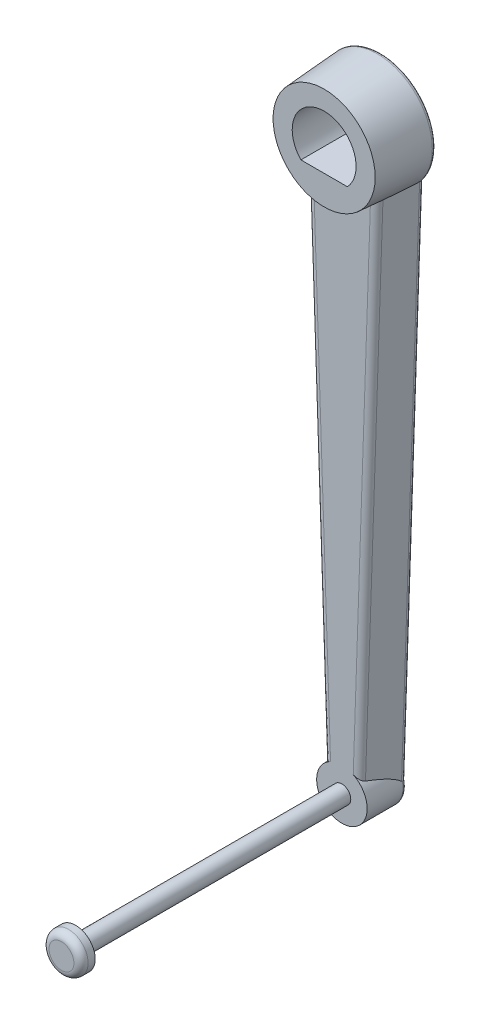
ISO-10303-21;
HEADER;
FILE_DESCRIPTION(('STEP AP214'),'2;1');
FILE_NAME('part.step','',(''),(''),'','','');
FILE_SCHEMA(('AUTOMOTIVE_DESIGN { 1 0 10303 214 1 1 1 1 }'));
ENDSEC;
DATA;
#1=APPLICATION_CONTEXT('core data for automotive mechanical design processes');
#2=APPLICATION_PROTOCOL_DEFINITION('international standard','automotive_design',2000,#1);
#3=PRODUCT_CONTEXT('',#1,'mechanical');
#4=PRODUCT('Part','Part','',(#3));
#5=PRODUCT_RELATED_PRODUCT_CATEGORY('part','',(#4));
#6=PRODUCT_DEFINITION_FORMATION('','',#4);
#7=PRODUCT_DEFINITION_CONTEXT('part definition',#1,'design');
#8=PRODUCT_DEFINITION('design','',#6,#7);
#9=PRODUCT_DEFINITION_SHAPE('','',#8);
#10=(LENGTH_UNIT() NAMED_UNIT(*) SI_UNIT(.MILLI.,.METRE.));
#11=(NAMED_UNIT(*) PLANE_ANGLE_UNIT() SI_UNIT($,.RADIAN.));
#12=(NAMED_UNIT(*) SI_UNIT($,.STERADIAN.) SOLID_ANGLE_UNIT());
#13=UNCERTAINTY_MEASURE_WITH_UNIT(LENGTH_MEASURE(1.E-05),#10,'distance_accuracy_value','');
#14=(GEOMETRIC_REPRESENTATION_CONTEXT(3) GLOBAL_UNCERTAINTY_ASSIGNED_CONTEXT((#13)) GLOBAL_UNIT_ASSIGNED_CONTEXT((#10,
#11,#12)) REPRESENTATION_CONTEXT('',''));
#15=CARTESIAN_POINT('',(0.,0.,0.));
#16=DIRECTION('',(0.,0.,1.));
#17=DIRECTION('',(1.,0.,0.));
#18=AXIS2_PLACEMENT_3D('',#15,#16,#17);
#19=CARTESIAN_POINT('',(-12.4082906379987,-4.96331625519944,11.));
#20=DIRECTION('',(0.,0.,1.));
#21=DIRECTION('',(1.,0.,0.));
#22=AXIS2_PLACEMENT_3D('',#19,#20,#21);
#23=PLANE('',#22);
#24=CARTESIAN_POINT('',(0.,-160.14967116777,11.));
#25=DIRECTION('',(0.,0.,1.));
#26=DIRECTION('',(1.,0.,0.));
#27=AXIS2_PLACEMENT_3D('',#24,#25,#26);
#28=CIRCLE('',#27,7.11408663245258);
#29=CARTESIAN_POINT('',(-3.19805453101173,-153.794934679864,11.));
#30=VERTEX_POINT('',#29);
#31=CARTESIAN_POINT('',(3.19805453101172,-153.794934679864,11.));
#32=VERTEX_POINT('',#31);
#33=EDGE_CURVE('E281',#30,#32,#28,.T.);
#34=ORIENTED_EDGE('',*,*,#33,.T.);
#35=DIRECTION('',(-0.0340953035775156,-0.999418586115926,0.));
#36=VECTOR('',#35,1.);
#37=CARTESIAN_POINT('',(8.25142116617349,-5.66812518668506,11.));
#38=LINE('',#37,#36);
#39=CARTESIAN_POINT('',(8.0233295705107,-12.3540600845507,11.));
#40=VERTEX_POINT('',#39);
#41=EDGE_CURVE('E312',#32,#40,#38,.F.);
#42=ORIENTED_EDGE('',*,*,#41,.T.);
#43=CARTESIAN_POINT('',(0.,0.,11.));
#44=DIRECTION('',(0.,0.,1.));
#45=DIRECTION('',(1.,0.,0.));
#46=AXIS2_PLACEMENT_3D('',#43,#44,#45);
#47=CIRCLE('',#46,14.7308050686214);
#48=CARTESIAN_POINT('',(-8.0233295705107,-12.3540600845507,11.));
#49=VERTEX_POINT('',#48);
#50=EDGE_CURVE('E297',#49,#40,#47,.T.);
#51=ORIENTED_EDGE('',*,*,#50,.F.);
#52=DIRECTION('',(-0.0340953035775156,0.999418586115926,0.));
#53=VECTOR('',#52,1.);
#54=CARTESIAN_POINT('',(-8.28027018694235,-4.82248826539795,11.));
#55=LINE('',#54,#53);
#56=EDGE_CURVE('E309',#49,#30,#55,.F.);
#57=ORIENTED_EDGE('',*,*,#56,.T.);
#58=EDGE_LOOP('',(#34,#42,#51,#57));
#59=FACE_BOUND('',#58,.T.);
#60=CARTESIAN_POINT('',(0.,-160.14967116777,11.));
#61=DIRECTION('',(0.,0.,1.));
#62=DIRECTION('',(1.,0.,0.));
#63=AXIS2_PLACEMENT_3D('',#60,#61,#62);
#64=CIRCLE('',#63,2.5);
#65=CARTESIAN_POINT('',(2.5,-160.14967116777,11.));
#66=VERTEX_POINT('',#65);
#67=EDGE_CURVE('E275',#66,#66,#64,.T.);
#68=ORIENTED_EDGE('',*,*,#67,.F.);
#69=EDGE_LOOP('',(#68));
#70=FACE_BOUND('',#69,.T.);
#71=ADVANCED_FACE('F29',(#59,#70),#23,.T.);
#72=CARTESIAN_POINT('',(0.,0.,0.));
#73=DIRECTION('',(0.,0.,-1.));
#74=DIRECTION('',(1.,0.,0.));
#75=AXIS2_PLACEMENT_3D('',#72,#73,#74);
#76=CONICAL_SURFACE('',#75,15.5,0.0698131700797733);
#77=CARTESIAN_POINT('',(0.,0.,16.));
#78=DIRECTION('',(0.,0.,1.));
#79=DIRECTION('',(1.,0.,0.));
#80=AXIS2_PLACEMENT_3D('',#77,#78,#79);
#81=CIRCLE('',#80,14.3811710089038);
#82=CARTESIAN_POINT('',(14.3811710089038,0.,16.));
#83=VERTEX_POINT('',#82);
#84=EDGE_CURVE('E294',#83,#83,#81,.T.);
#85=ORIENTED_EDGE('',*,*,#84,.F.);
#86=EDGE_LOOP('',(#85));
#87=FACE_BOUND('',#86,.T.);
#88=CARTESIAN_POINT('',(11.9920878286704,-9.69824440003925,1.10245594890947));
#89=CARTESIAN_POINT('',(11.9975123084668,-9.69406926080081,1.07964670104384));
#90=CARTESIAN_POINT('',(12.0019957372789,-9.69108390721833,1.05660248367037));
#91=CARTESIAN_POINT('',(12.0090804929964,-9.68749277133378,1.01004410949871));
#92=CARTESIAN_POINT('',(12.0116818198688,-9.68688698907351,0.986529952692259));
#93=CARTESIAN_POINT('',(12.0133420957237,-9.68747099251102,0.962780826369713));
#94=B_SPLINE_CURVE_WITH_KNOTS('',3,(#88,#89,#90,#91,#92,#93),.UNSPECIFIED.,.F.,.F.,(4,2,4),(0.,
0.0709960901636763,0.141992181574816),.UNSPECIFIED.);
#95=CARTESIAN_POINT('',(11.9920878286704,-9.69824440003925,1.10245594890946));
#96=VERTEX_POINT('',#95);
#97=CARTESIAN_POINT('',(12.0133420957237,-9.68747099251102,0.962780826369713));
#98=VERTEX_POINT('',#97);
#99=EDGE_CURVE('E358',#96,#98,#94,.T.);
#100=ORIENTED_EDGE('',*,*,#99,.T.);
#101=CARTESIAN_POINT('',(0.,0.,0.962780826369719));
#102=DIRECTION('',(0.,0.,1.));
#103=DIRECTION('',(1.,0.,0.));
#104=AXIS2_PLACEMENT_3D('',#101,#102,#103);
#105=CIRCLE('',#104,15.4326758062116);
#106=CARTESIAN_POINT('',(-12.0133420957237,-9.68747099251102,0.962780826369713));
#107=VERTEX_POINT('',#106);
#108=EDGE_CURVE('E56',#98,#107,#105,.T.);
#109=ORIENTED_EDGE('',*,*,#108,.T.);
#110=CARTESIAN_POINT('',(-12.0133420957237,-9.68747099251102,0.962780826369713));
#111=CARTESIAN_POINT('',(-12.0116818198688,-9.68688698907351,0.986529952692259));
#112=CARTESIAN_POINT('',(-12.0090804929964,-9.68749277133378,1.01004410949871));
#113=CARTESIAN_POINT('',(-12.0019957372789,-9.69108390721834,1.05660248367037));
#114=CARTESIAN_POINT('',(-11.9975123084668,-9.69406926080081,1.07964670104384));
#115=CARTESIAN_POINT('',(-11.9920878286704,-9.69824440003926,1.10245594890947));
#116=B_SPLINE_CURVE_WITH_KNOTS('',3,(#110,#111,#112,#113,#114,#115),.UNSPECIFIED.,.F.,.F.,(4,2,
4),(0.,0.0709960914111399,0.141992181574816),.UNSPECIFIED.);
#117=CARTESIAN_POINT('',(-11.9920878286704,-9.69824440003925,1.10245594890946));
#118=VERTEX_POINT('',#117);
#119=EDGE_CURVE('E11',#107,#118,#116,.T.);
#120=ORIENTED_EDGE('',*,*,#119,.T.);
#121=CARTESIAN_POINT('',(-3.89698772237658,-0.132946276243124,37.5584319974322));
#122=DIRECTION('',(-0.973803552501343,-0.0332214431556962,0.224951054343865));
#123=DIRECTION('',(-0.224820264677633,-0.00766977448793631,-0.974370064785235));
#124=AXIS2_PLACEMENT_3D('',#121,#122,#123);
#125=ELLIPSE('',#124,57.2287097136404,12.2689403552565);
#126=CARTESIAN_POINT('',(-10.0213012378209,-10.9441917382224,9.44990210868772));
#127=VERTEX_POINT('',#126);
#128=EDGE_CURVE('E291',#127,#118,#125,.F.);
#129=ORIENTED_EDGE('',*,*,#128,.F.);
#130=CARTESIAN_POINT('',(-10.0213012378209,-10.9441917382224,9.44990210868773));
#131=CARTESIAN_POINT('',(-10.0098667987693,-10.9500440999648,9.49858630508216));
#132=CARTESIAN_POINT('',(-9.99658420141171,-10.9576356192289,9.54659596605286));
#133=CARTESIAN_POINT('',(-9.96663316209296,-10.9759853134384,9.64084522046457));
#134=CARTESIAN_POINT('',(-9.94996993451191,-10.9867386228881,9.68708741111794));
#135=CARTESIAN_POINT('',(-9.91371704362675,-11.0109957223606,9.77707095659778));
#136=CARTESIAN_POINT('',(-9.89415894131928,-11.0244703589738,9.82083299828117));
#137=CARTESIAN_POINT('',(-9.85229387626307,-11.0539098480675,9.90615127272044));
#138=CARTESIAN_POINT('',(-9.82998589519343,-11.0698756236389,9.94770668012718));
#139=CARTESIAN_POINT('',(-9.75966804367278,-11.1208108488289,10.0683191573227));
#140=CARTESIAN_POINT('',(-9.70800891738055,-11.1589925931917,10.1439405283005));
#141=CARTESIAN_POINT('',(-9.59687782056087,-11.2416955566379,10.285560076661));
#142=CARTESIAN_POINT('',(-9.53738156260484,-11.2862365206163,10.3515269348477));
#143=CARTESIAN_POINT('',(-9.38101208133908,-11.4030480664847,10.5041587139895));
#144=CARTESIAN_POINT('',(-9.28027472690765,-11.4780860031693,10.5847829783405));
#145=CARTESIAN_POINT('',(-9.06866750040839,-11.6335984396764,10.7247754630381));
#146=CARTESIAN_POINT('',(-8.95777662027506,-11.7140841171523,10.7840983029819));
#147=CARTESIAN_POINT('',(-8.71320973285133,-11.8883256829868,10.8882124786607));
#148=CARTESIAN_POINT('',(-8.57847098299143,-11.9824154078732,10.9299944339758));
#149=CARTESIAN_POINT('',(-8.37245227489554,-12.1228503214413,10.9718924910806));
#150=CARTESIAN_POINT('',(-8.30328310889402,-12.1694442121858,10.9823955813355));
#151=CARTESIAN_POINT('',(-8.16395469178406,-12.2621694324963,10.9964429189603));
#152=CARTESIAN_POINT('',(-8.09379561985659,-12.3083008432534,10.9999884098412));
#153=CARTESIAN_POINT('',(-8.0233295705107,-12.3540600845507,11.));
#154=B_SPLINE_CURVE_WITH_KNOTS('',3,(#130,#131,#132,#133,#134,#135,#136,#137,#138,#139,#140,
#141,#142,#143,#144,#145,#146,#147,#148,#149,#150,#151,#152,#153),.UNSPECIFIED.,.F.,.F.,(4,2,2,
2,2,2,2,2,2,2,2,4),(0.,0.15093864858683,0.301646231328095,0.450817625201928,0.600044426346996,
0.896450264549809,1.19379728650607,1.63914544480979,2.085436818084,2.5914866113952,
2.84341205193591,3.09529246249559),.UNSPECIFIED.);
#155=EDGE_CURVE('E619',#127,#49,#154,.T.);
#156=ORIENTED_EDGE('',*,*,#155,.T.);
#157=ORIENTED_EDGE('',*,*,#50,.T.);
#158=CARTESIAN_POINT('',(8.0233295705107,-12.3540600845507,11.));
#159=CARTESIAN_POINT('',(8.09427896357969,-12.3079864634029,10.9999864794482));
#160=CARTESIAN_POINT('',(8.16490767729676,-12.2615425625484,10.996393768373));
#161=CARTESIAN_POINT('',(8.30515205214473,-12.1681929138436,10.9821591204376));
#162=CARTESIAN_POINT('',(8.37476762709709,-12.1212871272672,10.9715165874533));
#163=CARTESIAN_POINT('',(8.58268108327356,-11.9795145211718,10.9289409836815));
#164=CARTESIAN_POINT('',(8.71883634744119,-11.8843788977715,10.8863628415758));
#165=CARTESIAN_POINT('',(8.91525175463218,-11.7443472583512,10.8019076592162));
#166=CARTESIAN_POINT('',(8.97929160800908,-11.6982114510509,10.7704140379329));
#167=CARTESIAN_POINT('',(9.10447521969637,-11.6072619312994,10.7005310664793));
#168=CARTESIAN_POINT('',(9.16561867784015,-11.5624483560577,10.6621410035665));
#169=CARTESIAN_POINT('',(9.3434967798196,-11.4312110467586,10.5367132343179));
#170=CARTESIAN_POINT('',(9.45531095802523,-11.3475359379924,10.4391525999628));
#171=CARTESIAN_POINT('',(9.61940979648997,-11.2249226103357,10.2590454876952));
#172=CARTESIAN_POINT('',(9.67796578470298,-11.1812182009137,10.1853454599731));
#173=CARTESIAN_POINT('',(9.78548095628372,-11.1019526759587,10.0275634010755));
#174=CARTESIAN_POINT('',(9.83447587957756,-11.0663611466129,9.94352202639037));
#175=CARTESIAN_POINT('',(9.90804339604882,-11.0147691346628,9.79169240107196));
#176=CARTESIAN_POINT('',(9.93557872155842,-10.9960803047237,9.72625267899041));
#177=CARTESIAN_POINT('',(9.98385942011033,-10.9650495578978,9.59104376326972));
#178=CARTESIAN_POINT('',(10.0045636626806,-10.9527458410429,9.52125124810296));
#179=CARTESIAN_POINT('',(10.0213012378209,-10.9441917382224,9.44990210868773));
#180=B_SPLINE_CURVE_WITH_KNOTS('',3,(#158,#159,#160,#161,#162,#163,#164,#165,#166,#167,#168,
#169,#170,#171,#172,#173,#174,#175,#176,#177,#178,#179),.UNSPECIFIED.,.F.,.F.,(4,2,2,2,2,2,2,2,
2,2,4),(0.,0.253583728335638,0.507188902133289,1.01867540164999,1.27332866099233,
1.52800825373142,2.03493354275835,2.34529903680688,2.6544811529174,2.87405705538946,
3.09493188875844),.UNSPECIFIED.);
#181=CARTESIAN_POINT('',(10.0213012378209,-10.9441917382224,9.44990210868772));
#182=VERTEX_POINT('',#181);
#183=EDGE_CURVE('E323',#40,#182,#180,.T.);
#184=ORIENTED_EDGE('',*,*,#183,.T.);
#185=CARTESIAN_POINT('',(3.89698772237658,-0.132946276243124,37.5584319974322));
#186=DIRECTION('',(0.973803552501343,-0.0332214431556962,0.224951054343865));
#187=DIRECTION('',(0.224820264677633,-0.00766977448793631,-0.974370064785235));
#188=AXIS2_PLACEMENT_3D('',#185,#186,#187);
#189=ELLIPSE('',#188,57.2287097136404,12.2689403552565);
#190=EDGE_CURVE('E288',#182,#96,#189,.T.);
#191=ORIENTED_EDGE('',*,*,#190,.T.);
#192=EDGE_LOOP('',(#100,#109,#120,#129,#156,#157,#184,#191));
#193=FACE_BOUND('',#192,.T.);
#194=ADVANCED_FACE('F31',(#87,#193),#76,.T.);
#195=CARTESIAN_POINT('',(0.,0.,16.));
#196=DIRECTION('',(0.,0.,1.));
#197=DIRECTION('',(1.,0.,0.));
#198=AXIS2_PLACEMENT_3D('',#195,#196,#197);
#199=PLANE('',#198);
#200=CARTESIAN_POINT('',(0.,0.,16.));
#201=DIRECTION('',(0.,0.,1.));
#202=DIRECTION('',(1.,0.,0.));
#203=AXIS2_PLACEMENT_3D('',#200,#201,#202);
#204=CIRCLE('',#203,9.);
#205=CARTESIAN_POINT('',(6.55183226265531,-6.17037227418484,16.));
#206=VERTEX_POINT('',#205);
#207=CARTESIAN_POINT('',(-6.55183226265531,-6.17037227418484,16.));
#208=VERTEX_POINT('',#207);
#209=EDGE_CURVE('E262',#206,#208,#204,.T.);
#210=ORIENTED_EDGE('',*,*,#209,.F.);
#211=DIRECTION('',(1.,0.,0.));
#212=VECTOR('',#211,1.);
#213=CARTESIAN_POINT('',(-6.55183226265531,-6.17037227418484,16.));
#214=LINE('',#213,#212);
#215=EDGE_CURVE('E265',#208,#206,#214,.T.);
#216=ORIENTED_EDGE('',*,*,#215,.F.);
#217=EDGE_LOOP('',(#210,#216));
#218=FACE_BOUND('',#217,.T.);
#219=ORIENTED_EDGE('',*,*,#84,.T.);
#220=EDGE_LOOP('',(#219));
#221=FACE_BOUND('',#220,.T.);
#222=ADVANCED_FACE('F538',(#218,#221),#199,.T.);
#223=CARTESIAN_POINT('',(0.,0.,0.));
#224=DIRECTION('',(0.,0.,1.));
#225=DIRECTION('',(1.,0.,0.));
#226=AXIS2_PLACEMENT_3D('',#223,#224,#225);
#227=PLANE('',#226);
#228=CARTESIAN_POINT('',(0.,0.,0.));
#229=DIRECTION('',(0.,0.,1.));
#230=DIRECTION('',(1.,0.,0.));
#231=AXIS2_PLACEMENT_3D('',#228,#229,#230);
#232=CIRCLE('',#231,14.5348681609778);
#233=CARTESIAN_POINT('',(-11.1264483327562,-9.35224785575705,0.));
#234=VERTEX_POINT('',#233);
#235=CARTESIAN_POINT('',(11.1264483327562,-9.35224785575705,0.));
#236=VERTEX_POINT('',#235);
#237=EDGE_CURVE('E424',#234,#236,#232,.F.);
#238=ORIENTED_EDGE('',*,*,#237,.T.);
#239=DIRECTION('',(-0.0340953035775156,-0.999418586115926,0.));
#240=VECTOR('',#239,1.);
#241=CARTESIAN_POINT('',(11.432196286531,-0.390010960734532,0.));
#242=LINE('',#241,#240);
#243=CARTESIAN_POINT('',(6.03280527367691,-158.659660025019,0.));
#244=VERTEX_POINT('',#243);
#245=EDGE_CURVE('E420',#236,#244,#242,.T.);
#246=ORIENTED_EDGE('',*,*,#245,.T.);
#247=CARTESIAN_POINT('',(0.,-160.14967116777,0.));
#248=DIRECTION('',(0.,0.,1.));
#249=DIRECTION('',(1.,0.,0.));
#250=AXIS2_PLACEMENT_3D('',#247,#248,#249);
#251=CIRCLE('',#250,6.21408663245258);
#252=CARTESIAN_POINT('',(-6.03280527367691,-158.659660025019,0.));
#253=VERTEX_POINT('',#252);
#254=EDGE_CURVE('E646',#244,#253,#251,.F.);
#255=ORIENTED_EDGE('',*,*,#254,.T.);
#256=DIRECTION('',(-0.0340953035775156,0.999418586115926,0.));
#257=VECTOR('',#256,1.);
#258=CARTESIAN_POINT('',(-11.432196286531,-0.390010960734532,0.));
#259=LINE('',#258,#257);
#260=EDGE_CURVE('E648',#253,#234,#259,.T.);
#261=ORIENTED_EDGE('',*,*,#260,.T.);
#262=EDGE_LOOP('',(#238,#246,#255,#261));
#263=FACE_BOUND('',#262,.T.);
#264=DIRECTION('',(1.,0.,0.));
#265=VECTOR('',#264,1.);
#266=CARTESIAN_POINT('',(0.,-7.07037227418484,0.));
#267=LINE('',#266,#265);
#268=CARTESIAN_POINT('',(-6.92963461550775,-7.07037227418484,0.));
#269=VERTEX_POINT('',#268);
#270=CARTESIAN_POINT('',(6.92963461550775,-7.07037227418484,0.));
#271=VERTEX_POINT('',#270);
#272=EDGE_CURVE('E641',#269,#271,#267,.T.);
#273=ORIENTED_EDGE('',*,*,#272,.T.);
#274=CARTESIAN_POINT('',(0.,0.,0.));
#275=DIRECTION('',(0.,0.,1.));
#276=DIRECTION('',(1.,0.,0.));
#277=AXIS2_PLACEMENT_3D('',#274,#275,#276);
#278=CIRCLE('',#277,9.9);
#279=EDGE_CURVE('E643',#271,#269,#278,.T.);
#280=ORIENTED_EDGE('',*,*,#279,.T.);
#281=EDGE_LOOP('',(#273,#280));
#282=FACE_BOUND('',#281,.T.);
#283=DIRECTION('',(-1.,0.,0.));
#284=VECTOR('',#283,1.);
#285=CARTESIAN_POINT('',(0.,-8.15552423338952,0.));
#286=LINE('',#285,#284);
#287=CARTESIAN_POINT('',(6.62356623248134,-8.15552423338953,0.));
#288=VERTEX_POINT('',#287);
#289=CARTESIAN_POINT('',(-6.62356623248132,-8.15552423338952,0.));
#290=VERTEX_POINT('',#289);
#291=EDGE_CURVE('E638',#288,#290,#286,.T.);
#292=ORIENTED_EDGE('',*,*,#291,.T.);
#293=CARTESIAN_POINT('',(-6.62356623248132,-12.0555242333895,0.));
#294=DIRECTION('',(0.,0.,1.));
#295=DIRECTION('',(1.,0.,0.));
#296=AXIS2_PLACEMENT_3D('',#293,#294,#295);
#297=CIRCLE('',#296,3.9);
#298=CARTESIAN_POINT('',(-10.5212987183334,-12.1884959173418,0.));
#299=VERTEX_POINT('',#298);
#300=EDGE_CURVE('E471',#290,#299,#297,.T.);
#301=ORIENTED_EDGE('',*,*,#300,.T.);
#302=DIRECTION('',(0.0340953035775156,-0.999418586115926,0.));
#303=VECTOR('',#302,1.);
#304=CARTESIAN_POINT('',(-10.9243966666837,-0.372687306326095,0.));
#305=LINE('',#304,#303);
#306=CARTESIAN_POINT('',(-5.6860510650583,-153.921692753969,0.));
#307=VERTEX_POINT('',#306);
#308=EDGE_CURVE('E461',#299,#307,#305,.T.);
#309=ORIENTED_EDGE('',*,*,#308,.T.);
#310=CARTESIAN_POINT('',(-1.78831857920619,-153.788721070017,0.));
#311=DIRECTION('',(0.,0.,1.));
#312=DIRECTION('',(1.,0.,0.));
#313=AXIS2_PLACEMENT_3D('',#310,#311,#312);
#314=CIRCLE('',#313,3.9);
#315=CARTESIAN_POINT('',(-1.78831857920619,-157.688721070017,0.));
#316=VERTEX_POINT('',#315);
#317=EDGE_CURVE('E624',#307,#316,#314,.T.);
#318=ORIENTED_EDGE('',*,*,#317,.T.);
#319=DIRECTION('',(1.,0.,0.));
#320=VECTOR('',#319,1.);
#321=CARTESIAN_POINT('',(0.,-157.688721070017,0.));
#322=LINE('',#321,#320);
#323=CARTESIAN_POINT('',(1.78831857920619,-157.688721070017,0.));
#324=VERTEX_POINT('',#323);
#325=EDGE_CURVE('E631',#316,#324,#322,.T.);
#326=ORIENTED_EDGE('',*,*,#325,.T.);
#327=CARTESIAN_POINT('',(1.78831857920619,-153.788721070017,0.));
#328=DIRECTION('',(0.,0.,1.));
#329=DIRECTION('',(1.,0.,0.));
#330=AXIS2_PLACEMENT_3D('',#327,#328,#329);
#331=CIRCLE('',#330,3.9);
#332=CARTESIAN_POINT('',(5.6860510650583,-153.921692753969,0.));
#333=VERTEX_POINT('',#332);
#334=EDGE_CURVE('E633',#324,#333,#331,.T.);
#335=ORIENTED_EDGE('',*,*,#334,.T.);
#336=DIRECTION('',(0.0340953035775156,0.999418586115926,0.));
#337=VECTOR('',#336,1.);
#338=CARTESIAN_POINT('',(10.9243966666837,-0.372687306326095,0.));
#339=LINE('',#338,#337);
#340=CARTESIAN_POINT('',(10.5212987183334,-12.1884959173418,0.));
#341=VERTEX_POINT('',#340);
#342=EDGE_CURVE('E635',#333,#341,#339,.T.);
#343=ORIENTED_EDGE('',*,*,#342,.T.);
#344=CARTESIAN_POINT('',(6.62356623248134,-12.0555242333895,0.));
#345=DIRECTION('',(0.,0.,1.));
#346=DIRECTION('',(1.,0.,0.));
#347=AXIS2_PLACEMENT_3D('',#344,#345,#346);
#348=CIRCLE('',#347,3.89999999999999);
#349=EDGE_CURVE('E491',#341,#288,#348,.T.);
#350=ORIENTED_EDGE('',*,*,#349,.T.);
#351=EDGE_LOOP('',(#292,#301,#309,#318,#326,#335,#343,#350));
#352=FACE_BOUND('',#351,.T.);
#353=ADVANCED_FACE('F651',(#263,#282,#352),#227,.F.);
#354=CARTESIAN_POINT('',(-12.4082906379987,-4.96331625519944,0.));
#355=DIRECTION('',(-0.973803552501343,-0.0332214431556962,0.224951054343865));
#356=DIRECTION('',(0.225075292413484,0.,0.974341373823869));
#357=AXIS2_PLACEMENT_3D('',#354,#355,#356);
#358=PLANE('',#357);
#359=ORIENTED_EDGE('',*,*,#128,.T.);
#360=DIRECTION('',(0.0340953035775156,-0.999418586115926,0.));
#361=VECTOR('',#360,1.);
#362=CARTESIAN_POINT('',(-12.1539166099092,-4.95463824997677,1.10245594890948));
#363=LINE('',#362,#361);
#364=CARTESIAN_POINT('',(-6.91625350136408,-158.483638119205,1.10245594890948));
#365=VERTEX_POINT('',#364);
#366=EDGE_CURVE('E426',#118,#365,#363,.T.);
#367=ORIENTED_EDGE('',*,*,#366,.T.);
#368=CARTESIAN_POINT('',(0.,-160.14967116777,30.7965786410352));
#369=DIRECTION('',(-0.973803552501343,-0.0332214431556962,0.224951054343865));
#370=DIRECTION('',(0.224820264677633,0.00766977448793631,0.974370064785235));
#371=AXIS2_PLACEMENT_3D('',#368,#369,#370);
#372=ELLIPSE('',#371,31.6250424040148,7.11408663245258);
#373=CARTESIAN_POINT('',(-5.10033040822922,-155.190149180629,9.44990210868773));
#374=VERTEX_POINT('',#373);
#375=EDGE_CURVE('E286',#365,#374,#372,.F.);
#376=ORIENTED_EDGE('',*,*,#375,.T.);
#377=DIRECTION('',(0.0340953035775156,-0.999418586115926,0.));
#378=VECTOR('',#377,1.);
#379=CARTESIAN_POINT('',(-10.227877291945,-4.88893115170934,9.44990210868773));
#380=LINE('',#379,#378);
#381=EDGE_CURVE('E314',#374,#127,#380,.F.);
#382=ORIENTED_EDGE('',*,*,#381,.T.);
#383=EDGE_LOOP('',(#359,#367,#376,#382));
#384=FACE_BOUND('',#383,.T.);
#385=ADVANCED_FACE('F657',(#384),#358,.T.);
#386=CARTESIAN_POINT('',(12.4082906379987,-4.96331625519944,0.));
#387=DIRECTION('',(0.973803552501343,-0.0332214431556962,0.224951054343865));
#388=DIRECTION('',(0.225075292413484,0.,-0.974341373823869));
#389=AXIS2_PLACEMENT_3D('',#386,#387,#388);
#390=PLANE('',#389);
#391=CARTESIAN_POINT('',(0.,-160.14967116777,30.7965786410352));
#392=DIRECTION('',(0.973803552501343,-0.0332214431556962,0.224951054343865));
#393=DIRECTION('',(-0.224820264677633,0.00766977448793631,0.974370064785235));
#394=AXIS2_PLACEMENT_3D('',#391,#392,#393);
#395=ELLIPSE('',#394,31.6250424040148,7.11408663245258);
#396=CARTESIAN_POINT('',(6.91625350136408,-158.483638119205,1.10245594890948));
#397=VERTEX_POINT('',#396);
#398=CARTESIAN_POINT('',(5.10033040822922,-155.190149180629,9.44990210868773));
#399=VERTEX_POINT('',#398);
#400=EDGE_CURVE('E284',#397,#399,#395,.T.);
#401=ORIENTED_EDGE('',*,*,#400,.F.);
#402=DIRECTION('',(-0.0340953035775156,-0.999418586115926,0.));
#403=VECTOR('',#402,1.);
#404=CARTESIAN_POINT('',(12.3086194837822,-0.419910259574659,1.10245594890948));
#405=LINE('',#404,#403);
#406=EDGE_CURVE('E427',#397,#96,#405,.F.);
#407=ORIENTED_EDGE('',*,*,#406,.T.);
#408=ORIENTED_EDGE('',*,*,#190,.F.);
#409=DIRECTION('',(-0.0340953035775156,-0.999418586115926,0.));
#410=VECTOR('',#409,1.);
#411=CARTESIAN_POINT('',(10.227877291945,-4.88893115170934,9.44990210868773));
#412=LINE('',#411,#410);
#413=EDGE_CURVE('E306',#182,#399,#412,.T.);
#414=ORIENTED_EDGE('',*,*,#413,.T.);
#415=EDGE_LOOP('',(#401,#407,#408,#414));
#416=FACE_BOUND('',#415,.T.);
#417=ADVANCED_FACE('F338',(#416),#390,.T.);
#418=CARTESIAN_POINT('',(0.,-160.14967116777,0.));
#419=DIRECTION('',(0.,0.,1.));
#420=DIRECTION('',(1.,0.,0.));
#421=AXIS2_PLACEMENT_3D('',#418,#419,#420);
#422=CYLINDRICAL_SURFACE('',#421,7.11408663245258);
#423=CARTESIAN_POINT('',(-6.91625350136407,-158.483638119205,1.10245594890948));
#424=CARTESIAN_POINT('',(-6.91897318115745,-158.494922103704,1.08899641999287));
#425=CARTESIAN_POINT('',(-6.92153248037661,-158.505674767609,1.07493371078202));
#426=CARTESIAN_POINT('',(-6.92621934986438,-158.525536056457,1.04531678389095));
#427=CARTESIAN_POINT('',(-6.9283395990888,-158.534616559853,1.02974279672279));
#428=CARTESIAN_POINT('',(-6.93159266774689,-158.548642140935,1.00039778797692));
#429=CARTESIAN_POINT('',(-6.93283737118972,-158.554048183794,0.986866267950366));
#430=CARTESIAN_POINT('',(-6.93479889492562,-158.562594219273,0.959152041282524));
#431=CARTESIAN_POINT('',(-6.93551955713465,-158.56575070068,0.944974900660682));
#432=CARTESIAN_POINT('',(-6.93624935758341,-158.568952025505,0.92047989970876));
#433=CARTESIAN_POINT('',(-6.9364049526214,-158.569636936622,0.910246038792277));
#434=CARTESIAN_POINT('',(-6.93640070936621,-158.569616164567,0.900000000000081));
#435=B_SPLINE_CURVE_WITH_KNOTS('',3,(#423,#424,#425,#426,#427,#428,#429,#430,#431,#432,#433,
#434),.UNSPECIFIED.,.F.,.F.,(4,2,2,2,2,4),(0.,0.0534517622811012,0.107733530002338,
0.151444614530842,0.194831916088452,0.225529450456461),.UNSPECIFIED.);
#436=CARTESIAN_POINT('',(-6.93640070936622,-158.569616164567,0.9));
#437=VERTEX_POINT('',#436);
#438=EDGE_CURVE('E42',#365,#437,#435,.T.);
#439=ORIENTED_EDGE('',*,*,#438,.T.);
#440=CARTESIAN_POINT('',(0.,-160.14967116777,0.9));
#441=DIRECTION('',(0.,0.,1.));
#442=DIRECTION('',(1.,0.,0.));
#443=AXIS2_PLACEMENT_3D('',#440,#441,#442);
#444=CIRCLE('',#443,7.11408663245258);
#445=CARTESIAN_POINT('',(6.93640070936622,-158.569616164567,0.9));
#446=VERTEX_POINT('',#445);
#447=EDGE_CURVE('E49',#437,#446,#444,.T.);
#448=ORIENTED_EDGE('',*,*,#447,.T.);
#449=CARTESIAN_POINT('',(6.93640070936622,-158.569616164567,0.9));
#450=CARTESIAN_POINT('',(6.93640958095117,-158.569660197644,0.914367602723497));
#451=CARTESIAN_POINT('',(6.93610172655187,-158.568303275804,0.928671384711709));
#452=CARTESIAN_POINT('',(6.93493853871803,-158.563207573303,0.956653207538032));
#453=CARTESIAN_POINT('',(6.93408996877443,-158.559498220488,0.970336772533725));
#454=CARTESIAN_POINT('',(6.93155922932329,-158.548498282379,1.00148216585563));
#455=CARTESIAN_POINT('',(6.92969154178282,-158.540418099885,1.01864269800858));
#456=CARTESIAN_POINT('',(6.92533633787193,-158.52177782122,1.05151929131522));
#457=CARTESIAN_POINT('',(6.9228458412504,-158.511205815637,1.06722789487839));
#458=CARTESIAN_POINT('',(6.91888086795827,-158.494574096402,1.08912556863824));
#459=CARTESIAN_POINT('',(6.91758743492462,-158.489174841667,1.09585912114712));
#460=CARTESIAN_POINT('',(6.91625350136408,-158.483638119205,1.10245594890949));
#461=B_SPLINE_CURVE_WITH_KNOTS('',3,(#449,#450,#451,#452,#453,#454,#455,#456,#457,#458,#459,
#460),.UNSPECIFIED.,.F.,.F.,(4,2,2,2,2,4),(0.,0.042933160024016,0.0853395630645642,
0.142195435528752,0.199328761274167,0.225492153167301),.UNSPECIFIED.);
#462=EDGE_CURVE('E351',#446,#397,#461,.T.);
#463=ORIENTED_EDGE('',*,*,#462,.T.);
#464=ORIENTED_EDGE('',*,*,#400,.T.);
#465=CARTESIAN_POINT('',(5.10033040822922,-155.190149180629,9.44990210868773));
#466=CARTESIAN_POINT('',(5.07655407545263,-155.165700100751,9.55644636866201));
#467=CARTESIAN_POINT('',(5.04484844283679,-155.133428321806,9.65866909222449));
#468=CARTESIAN_POINT('',(4.96826565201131,-155.05757778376,9.85243407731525));
#469=CARTESIAN_POINT('',(4.9235110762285,-155.014104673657,9.94406512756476));
#470=CARTESIAN_POINT('',(4.81226842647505,-154.909510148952,10.1350089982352));
#471=CARTESIAN_POINT('',(4.74318023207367,-154.846602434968,10.2317847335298));
#472=CARTESIAN_POINT('',(4.59125795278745,-154.714528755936,10.4096157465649));
#473=CARTESIAN_POINT('',(4.50836472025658,-154.645336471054,10.4905999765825));
#474=CARTESIAN_POINT('',(4.32977113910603,-154.503747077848,10.6368780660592));
#475=CARTESIAN_POINT('',(4.23392413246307,-154.431320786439,10.7019639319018));
#476=CARTESIAN_POINT('',(4.03207750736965,-154.287255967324,10.8140350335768));
#477=CARTESIAN_POINT('',(3.926105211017,-154.215615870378,10.8610673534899));
#478=CARTESIAN_POINT('',(3.71856035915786,-154.083716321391,10.9313152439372));
#479=CARTESIAN_POINT('',(3.61794455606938,-154.023111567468,10.9566865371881));
#480=CARTESIAN_POINT('',(3.46315953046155,-153.935147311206,10.9824474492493));
#481=CARTESIAN_POINT('',(3.41082440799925,-153.906267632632,10.9889856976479));
#482=CARTESIAN_POINT('',(3.30513571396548,-153.849678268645,10.9977626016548));
#483=CARTESIAN_POINT('',(3.25178160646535,-153.821969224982,10.9999989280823));
#484=CARTESIAN_POINT('',(3.19805453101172,-153.794934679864,11.));
#485=B_SPLINE_CURVE_WITH_KNOTS('',3,(#465,#466,#467,#468,#469,#470,#471,#472,#473,#474,#475,
#476,#477,#478,#479,#480,#481,#482,#483,#484),.UNSPECIFIED.,.F.,.F.,(4,2,2,2,2,2,2,2,2,4),(0.,
0.333930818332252,0.664820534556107,1.0663593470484,1.46966503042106,1.87799405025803,
2.28525078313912,2.64444403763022,2.82468308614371,3.00501969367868),.UNSPECIFIED.);
#486=EDGE_CURVE('E316',#399,#32,#485,.T.);
#487=ORIENTED_EDGE('',*,*,#486,.T.);
#488=ORIENTED_EDGE('',*,*,#33,.F.);
#489=CARTESIAN_POINT('',(-3.19805453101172,-153.794934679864,11.));
#490=CARTESIAN_POINT('',(-3.2608575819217,-153.826529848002,11.0000017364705));
#491=CARTESIAN_POINT('',(-3.32316126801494,-153.859061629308,10.9969436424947));
#492=CARTESIAN_POINT('',(-3.44630717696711,-153.92568077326,10.9849858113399));
#493=CARTESIAN_POINT('',(-3.50715040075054,-153.959767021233,10.9760902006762));
#494=CARTESIAN_POINT('',(-3.62671290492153,-154.029055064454,10.9527910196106));
#495=CARTESIAN_POINT('',(-3.6854410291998,-154.064250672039,10.9384142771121));
#496=CARTESIAN_POINT('',(-3.80075410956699,-154.135595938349,10.9044161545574));
#497=CARTESIAN_POINT('',(-3.85733867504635,-154.17174576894,10.8847938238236));
#498=CARTESIAN_POINT('',(-4.02310542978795,-154.280917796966,10.8185568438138));
#499=CARTESIAN_POINT('',(-4.12875052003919,-154.35492546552,10.7644816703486));
#500=CARTESIAN_POINT('',(-4.32895540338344,-154.502907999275,10.6376855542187));
#501=CARTESIAN_POINT('',(-4.4234731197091,-154.576881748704,10.5648969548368));
#502=CARTESIAN_POINT('',(-4.55865009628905,-154.687738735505,10.4392748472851));
#503=CARTESIAN_POINT('',(-4.60406108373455,-154.726009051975,10.3926970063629));
#504=CARTESIAN_POINT('',(-4.69066855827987,-154.800733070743,10.2944553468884));
#505=CARTESIAN_POINT('',(-4.73186378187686,-154.837186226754,10.2427900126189));
#506=CARTESIAN_POINT('',(-4.84803438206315,-154.942220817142,10.0807835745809));
#507=CARTESIAN_POINT('',(-4.91632564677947,-155.007090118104,9.96276376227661));
#508=CARTESIAN_POINT('',(-4.99980081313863,-155.088675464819,9.77529613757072));
#509=CARTESIAN_POINT('',(-5.02402581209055,-155.112773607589,9.71294794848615));
#510=CARTESIAN_POINT('',(-5.06671553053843,-155.155723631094,9.58426475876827));
#511=CARTESIAN_POINT('',(-5.08515444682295,-155.174551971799,9.51791342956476));
#512=CARTESIAN_POINT('',(-5.10033040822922,-155.190149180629,9.44990210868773));
#513=B_SPLINE_CURVE_WITH_KNOTS('',3,(#489,#490,#491,#492,#493,#494,#495,#496,#497,#498,#499,
#500,#501,#502,#503,#504,#505,#506,#507,#508,#509,#510,#511,#512),.UNSPECIFIED.,.F.,.F.,(4,2,2,
2,2,2,2,2,2,2,2,4),(0.,0.210796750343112,0.421444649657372,0.631074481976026,0.840742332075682,
1.25850994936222,1.67780974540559,1.90393813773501,2.13013410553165,2.57908022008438,
2.79190892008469,3.0056736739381),.UNSPECIFIED.);
#514=EDGE_CURVE('E345',#30,#374,#513,.T.);
#515=ORIENTED_EDGE('',*,*,#514,.T.);
#516=ORIENTED_EDGE('',*,*,#375,.F.);
#517=EDGE_LOOP('',(#439,#448,#463,#464,#487,#488,#515,#516));
#518=FACE_BOUND('',#517,.T.);
#519=ADVANCED_FACE('F332',(#518),#422,.T.);
#520=CARTESIAN_POINT('',(0.,-160.14967116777,86.));
#521=DIRECTION('',(0.,0.,-1.));
#522=DIRECTION('',(-1.,0.,0.));
#523=AXIS2_PLACEMENT_3D('',#520,#521,#522);
#524=CYLINDRICAL_SURFACE('',#523,2.5);
#525=CARTESIAN_POINT('',(0.,-160.14967116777,86.));
#526=DIRECTION('',(0.,0.,1.));
#527=DIRECTION('',(1.,0.,0.));
#528=AXIS2_PLACEMENT_3D('',#525,#526,#527);
#529=CIRCLE('',#528,2.5);
#530=CARTESIAN_POINT('',(2.5,-160.14967116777,86.));
#531=VERTEX_POINT('',#530);
#532=EDGE_CURVE('E278',#531,#531,#529,.T.);
#533=ORIENTED_EDGE('',*,*,#532,.F.);
#534=EDGE_LOOP('',(#533));
#535=FACE_BOUND('',#534,.T.);
#536=ORIENTED_EDGE('',*,*,#67,.T.);
#537=EDGE_LOOP('',(#536));
#538=FACE_BOUND('',#537,.T.);
#539=ADVANCED_FACE('F337',(#535,#538),#524,.T.);
#540=CARTESIAN_POINT('',(0.,-160.14967116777,86.));
#541=DIRECTION('',(0.,0.,1.));
#542=DIRECTION('',(1.,0.,0.));
#543=AXIS2_PLACEMENT_3D('',#540,#541,#542);
#544=PLANE('',#543);
#545=CARTESIAN_POINT('',(0.,-160.14967116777,86.));
#546=DIRECTION('',(0.,0.,1.));
#547=DIRECTION('',(1.,0.,0.));
#548=AXIS2_PLACEMENT_3D('',#545,#546,#547);
#549=CIRCLE('',#548,5.5);
#550=CARTESIAN_POINT('',(5.5,-160.14967116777,86.));
#551=VERTEX_POINT('',#550);
#552=EDGE_CURVE('E272',#551,#551,#549,.T.);
#553=ORIENTED_EDGE('',*,*,#552,.F.);
#554=EDGE_LOOP('',(#553));
#555=FACE_BOUND('',#554,.T.);
#556=ORIENTED_EDGE('',*,*,#532,.T.);
#557=EDGE_LOOP('',(#556));
#558=FACE_BOUND('',#557,.T.);
#559=ADVANCED_FACE('F546',(#555,#558),#544,.F.);
#560=CARTESIAN_POINT('',(0.,-160.14967116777,90.));
#561=DIRECTION('',(0.,0.,-1.));
#562=DIRECTION('',(-1.,0.,0.));
#563=AXIS2_PLACEMENT_3D('',#560,#561,#562);
#564=CYLINDRICAL_SURFACE('',#563,5.5);
#565=CARTESIAN_POINT('',(0.,-160.14967116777,88.));
#566=DIRECTION('',(0.,0.,1.));
#567=DIRECTION('',(1.,0.,0.));
#568=AXIS2_PLACEMENT_3D('',#565,#566,#567);
#569=CIRCLE('',#568,5.5);
#570=CARTESIAN_POINT('',(5.5,-160.14967116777,88.));
#571=VERTEX_POINT('',#570);
#572=EDGE_CURVE('E303',#571,#571,#569,.F.);
#573=ORIENTED_EDGE('',*,*,#572,.T.);
#574=EDGE_LOOP('',(#573));
#575=FACE_BOUND('',#574,.T.);
#576=ORIENTED_EDGE('',*,*,#552,.T.);
#577=EDGE_LOOP('',(#576));
#578=FACE_BOUND('',#577,.T.);
#579=ADVANCED_FACE('F551',(#575,#578),#564,.T.);
#580=CARTESIAN_POINT('',(0.,-160.14967116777,90.));
#581=DIRECTION('',(0.,0.,1.));
#582=DIRECTION('',(1.,0.,0.));
#583=AXIS2_PLACEMENT_3D('',#580,#581,#582);
#584=PLANE('',#583);
#585=CARTESIAN_POINT('',(0.,-160.14967116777,90.));
#586=DIRECTION('',(0.,0.,1.));
#587=DIRECTION('',(1.,0.,0.));
#588=AXIS2_PLACEMENT_3D('',#585,#586,#587);
#589=CIRCLE('',#588,3.5);
#590=CARTESIAN_POINT('',(3.5,-160.14967116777,90.));
#591=VERTEX_POINT('',#590);
#592=EDGE_CURVE('E300',#591,#591,#589,.T.);
#593=ORIENTED_EDGE('',*,*,#592,.T.);
#594=EDGE_LOOP('',(#593));
#595=FACE_BOUND('',#594,.T.);
#596=ADVANCED_FACE('F554',(#595),#584,.T.);
#597=CARTESIAN_POINT('',(0.,-160.14967116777,88.));
#598=DIRECTION('',(0.,0.,1.));
#599=DIRECTION('',(1.,0.,0.));
#600=AXIS2_PLACEMENT_3D('',#597,#598,#599);
#601=TOROIDAL_SURFACE('',#600,3.5,2.);
#602=ORIENTED_EDGE('',*,*,#572,.F.);
#603=EDGE_LOOP('',(#602));
#604=FACE_BOUND('',#603,.T.);
#605=ORIENTED_EDGE('',*,*,#592,.F.);
#606=EDGE_LOOP('',(#605));
#607=FACE_BOUND('',#606,.T.);
#608=ADVANCED_FACE('F561',(#604,#607),#601,.T.);
#609=CARTESIAN_POINT('',(0.,0.,0.));
#610=DIRECTION('',(0.,0.,1.));
#611=DIRECTION('',(1.,0.,0.));
#612=AXIS2_PLACEMENT_3D('',#609,#610,#611);
#613=CYLINDRICAL_SURFACE('',#612,9.);
#614=DIRECTION('',(0.,0.,1.));
#615=VECTOR('',#614,1.);
#616=CARTESIAN_POINT('',(-6.55183226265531,-6.17037227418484,0.));
#617=LINE('',#616,#615);
#618=CARTESIAN_POINT('',(-6.55183226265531,-6.17037227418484,0.9));
#619=VERTEX_POINT('',#618);
#620=EDGE_CURVE('E268',#619,#208,#617,.T.);
#621=ORIENTED_EDGE('',*,*,#620,.F.);
#622=CARTESIAN_POINT('',(0.,0.,0.9));
#623=DIRECTION('',(0.,0.,1.));
#624=DIRECTION('',(1.,0.,0.));
#625=AXIS2_PLACEMENT_3D('',#622,#623,#624);
#626=CIRCLE('',#625,9.);
#627=CARTESIAN_POINT('',(6.55183226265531,-6.17037227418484,0.9));
#628=VERTEX_POINT('',#627);
#629=EDGE_CURVE('E434',#619,#628,#626,.F.);
#630=ORIENTED_EDGE('',*,*,#629,.T.);
#631=DIRECTION('',(0.,0.,1.));
#632=VECTOR('',#631,1.);
#633=CARTESIAN_POINT('',(6.55183226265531,-6.17037227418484,0.));
#634=LINE('',#633,#632);
#635=EDGE_CURVE('E270',#628,#206,#634,.T.);
#636=ORIENTED_EDGE('',*,*,#635,.T.);
#637=ORIENTED_EDGE('',*,*,#209,.T.);
#638=EDGE_LOOP('',(#621,#630,#636,#637));
#639=FACE_BOUND('',#638,.T.);
#640=ADVANCED_FACE('F570',(#639),#613,.F.);
#641=CARTESIAN_POINT('',(-6.55183226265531,-6.17037227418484,0.));
#642=DIRECTION('',(0.,-1.,0.));
#643=DIRECTION('',(0.,0.,-1.));
#644=AXIS2_PLACEMENT_3D('',#641,#642,#643);
#645=PLANE('',#644);
#646=ORIENTED_EDGE('',*,*,#635,.F.);
#647=DIRECTION('',(1.,0.,0.));
#648=VECTOR('',#647,1.);
#649=CARTESIAN_POINT('',(-6.55183226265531,-6.17037227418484,0.9));
#650=LINE('',#649,#648);
#651=EDGE_CURVE('E437',#628,#619,#650,.F.);
#652=ORIENTED_EDGE('',*,*,#651,.T.);
#653=ORIENTED_EDGE('',*,*,#620,.T.);
#654=ORIENTED_EDGE('',*,*,#215,.T.);
#655=EDGE_LOOP('',(#646,#652,#653,#654));
#656=FACE_BOUND('',#655,.T.);
#657=ADVANCED_FACE('F577',(#656),#645,.F.);
#658=CARTESIAN_POINT('',(-1.78831857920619,-153.788721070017,3.));
#659=DIRECTION('',(0.,0.,-1.));
#660=DIRECTION('',(-1.,0.,0.));
#661=AXIS2_PLACEMENT_3D('',#658,#659,#660);
#662=CYLINDRICAL_SURFACE('',#661,3.);
#663=DIRECTION('',(0.,0.,-1.));
#664=VECTOR('',#663,1.);
#665=CARTESIAN_POINT('',(-1.78831857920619,-156.788721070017,3.));
#666=LINE('',#665,#664);
#667=CARTESIAN_POINT('',(-1.78831857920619,-156.788721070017,3.));
#668=VERTEX_POINT('',#667);
#669=CARTESIAN_POINT('',(-1.78831857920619,-156.788721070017,0.9));
#670=VERTEX_POINT('',#669);
#671=EDGE_CURVE('E260',#668,#670,#666,.T.);
#672=ORIENTED_EDGE('',*,*,#671,.T.);
#673=CARTESIAN_POINT('',(-1.78831857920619,-153.788721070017,0.9));
#674=DIRECTION('',(0.,0.,1.));
#675=DIRECTION('',(1.,0.,0.));
#676=AXIS2_PLACEMENT_3D('',#673,#674,#675);
#677=CIRCLE('',#676,3.);
#678=CARTESIAN_POINT('',(-4.78657433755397,-153.891006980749,0.9));
#679=VERTEX_POINT('',#678);
#680=EDGE_CURVE('E208',#670,#679,#677,.F.);
#681=ORIENTED_EDGE('',*,*,#680,.T.);
#682=DIRECTION('',(0.,0.,-1.));
#683=VECTOR('',#682,1.);
#684=CARTESIAN_POINT('',(-4.78657433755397,-153.891006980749,3.));
#685=LINE('',#684,#683);
#686=CARTESIAN_POINT('',(-4.78657433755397,-153.891006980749,3.));
#687=VERTEX_POINT('',#686);
#688=EDGE_CURVE('E201',#687,#679,#685,.T.);
#689=ORIENTED_EDGE('',*,*,#688,.F.);
#690=CARTESIAN_POINT('',(-1.78831857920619,-153.788721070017,3.));
#691=DIRECTION('',(0.,0.,-1.));
#692=DIRECTION('',(-1.,0.,0.));
#693=AXIS2_PLACEMENT_3D('',#690,#691,#692);
#694=CIRCLE('',#693,3.);
#695=EDGE_CURVE('E205',#668,#687,#694,.T.);
#696=ORIENTED_EDGE('',*,*,#695,.F.);
#697=EDGE_LOOP('',(#672,#681,#689,#696));
#698=FACE_BOUND('',#697,.T.);
#699=ADVANCED_FACE('F204',(#698),#662,.F.);
#700=CARTESIAN_POINT('',(-1.78831857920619,-156.788721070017,3.));
#701=DIRECTION('',(0.,1.,0.));
#702=DIRECTION('',(0.,0.,1.));
#703=AXIS2_PLACEMENT_3D('',#700,#701,#702);
#704=PLANE('',#703);
#705=DIRECTION('',(0.,0.,-1.));
#706=VECTOR('',#705,1.);
#707=CARTESIAN_POINT('',(1.78831857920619,-156.788721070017,3.));
#708=LINE('',#707,#706);
#709=CARTESIAN_POINT('',(1.78831857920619,-156.788721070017,3.));
#710=VERTEX_POINT('',#709);
#711=CARTESIAN_POINT('',(1.78831857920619,-156.788721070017,0.9));
#712=VERTEX_POINT('',#711);
#713=EDGE_CURVE('E257',#710,#712,#708,.T.);
#714=ORIENTED_EDGE('',*,*,#713,.T.);
#715=DIRECTION('',(1.,0.,0.));
#716=VECTOR('',#715,1.);
#717=CARTESIAN_POINT('',(0.,-156.788721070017,0.9));
#718=LINE('',#717,#716);
#719=EDGE_CURVE('E450',#712,#670,#718,.F.);
#720=ORIENTED_EDGE('',*,*,#719,.T.);
#721=ORIENTED_EDGE('',*,*,#671,.F.);
#722=DIRECTION('',(1.,0.,0.));
#723=VECTOR('',#722,1.);
#724=CARTESIAN_POINT('',(-1.78831857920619,-156.788721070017,3.));
#725=LINE('',#724,#723);
#726=EDGE_CURVE('E213',#668,#710,#725,.T.);
#727=ORIENTED_EDGE('',*,*,#726,.T.);
#728=EDGE_LOOP('',(#714,#720,#721,#727));
#729=FACE_BOUND('',#728,.T.);
#730=ADVANCED_FACE('F585',(#729),#704,.T.);
#731=CARTESIAN_POINT('',(1.78831857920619,-153.788721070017,3.));
#732=DIRECTION('',(0.,0.,-1.));
#733=DIRECTION('',(-1.,0.,0.));
#734=AXIS2_PLACEMENT_3D('',#731,#732,#733);
#735=CYLINDRICAL_SURFACE('',#734,3.);
#736=DIRECTION('',(0.,0.,-1.));
#737=VECTOR('',#736,1.);
#738=CARTESIAN_POINT('',(4.78657433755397,-153.891006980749,3.));
#739=LINE('',#738,#737);
#740=CARTESIAN_POINT('',(4.78657433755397,-153.891006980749,3.));
#741=VERTEX_POINT('',#740);
#742=CARTESIAN_POINT('',(4.78657433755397,-153.891006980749,0.9));
#743=VERTEX_POINT('',#742);
#744=EDGE_CURVE('E254',#741,#743,#739,.T.);
#745=ORIENTED_EDGE('',*,*,#744,.T.);
#746=CARTESIAN_POINT('',(1.78831857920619,-153.788721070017,0.9));
#747=DIRECTION('',(0.,0.,1.));
#748=DIRECTION('',(1.,0.,0.));
#749=AXIS2_PLACEMENT_3D('',#746,#747,#748);
#750=CIRCLE('',#749,3.);
#751=EDGE_CURVE('E448',#743,#712,#750,.F.);
#752=ORIENTED_EDGE('',*,*,#751,.T.);
#753=ORIENTED_EDGE('',*,*,#713,.F.);
#754=CARTESIAN_POINT('',(1.78831857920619,-153.788721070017,3.));
#755=DIRECTION('',(0.,0.,-1.));
#756=DIRECTION('',(-1.,0.,0.));
#757=AXIS2_PLACEMENT_3D('',#754,#755,#756);
#758=CIRCLE('',#757,3.);
#759=EDGE_CURVE('E241',#741,#710,#758,.T.);
#760=ORIENTED_EDGE('',*,*,#759,.F.);
#761=EDGE_LOOP('',(#745,#752,#753,#760));
#762=FACE_BOUND('',#761,.T.);
#763=ADVANCED_FACE('F588',(#762),#735,.F.);
#764=CARTESIAN_POINT('',(4.78657433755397,-153.891006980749,3.));
#765=DIRECTION('',(-0.999418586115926,0.0340953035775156,0.));
#766=DIRECTION('',(-0.0340953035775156,-0.999418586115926,0.));
#767=AXIS2_PLACEMENT_3D('',#764,#765,#766);
#768=PLANE('',#767);
#769=DIRECTION('',(0.,0.,-1.));
#770=VECTOR('',#769,1.);
#771=CARTESIAN_POINT('',(9.6218219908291,-12.1578101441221,3.));
#772=LINE('',#771,#770);
#773=CARTESIAN_POINT('',(9.6218219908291,-12.1578101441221,3.));
#774=VERTEX_POINT('',#773);
#775=CARTESIAN_POINT('',(9.6218219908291,-12.1578101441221,0.9));
#776=VERTEX_POINT('',#775);
#777=EDGE_CURVE('E251',#774,#776,#772,.T.);
#778=ORIENTED_EDGE('',*,*,#777,.T.);
#779=DIRECTION('',(0.0340953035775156,0.999418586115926,0.));
#780=VECTOR('',#779,1.);
#781=CARTESIAN_POINT('',(10.0249199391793,-0.342001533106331,0.9));
#782=LINE('',#781,#780);
#783=EDGE_CURVE('E446',#776,#743,#782,.F.);
#784=ORIENTED_EDGE('',*,*,#783,.T.);
#785=ORIENTED_EDGE('',*,*,#744,.F.);
#786=DIRECTION('',(0.0340953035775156,0.999418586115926,0.));
#787=VECTOR('',#786,1.);
#788=CARTESIAN_POINT('',(4.78657433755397,-153.891006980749,3.));
#789=LINE('',#788,#787);
#790=EDGE_CURVE('E238',#741,#774,#789,.T.);
#791=ORIENTED_EDGE('',*,*,#790,.T.);
#792=EDGE_LOOP('',(#778,#784,#785,#791));
#793=FACE_BOUND('',#792,.T.);
#794=ADVANCED_FACE('F592',(#793),#768,.T.);
#795=CARTESIAN_POINT('',(6.62356623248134,-12.0555242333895,3.));
#796=DIRECTION('',(0.,0.,-1.));
#797=DIRECTION('',(-1.,0.,0.));
#798=AXIS2_PLACEMENT_3D('',#795,#796,#797);
#799=CYLINDRICAL_SURFACE('',#798,2.99999999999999);
#800=DIRECTION('',(0.,0.,-1.));
#801=VECTOR('',#800,1.);
#802=CARTESIAN_POINT('',(6.62356623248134,-9.05552423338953,3.));
#803=LINE('',#802,#801);
#804=CARTESIAN_POINT('',(6.62356623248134,-9.05552423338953,3.));
#805=VERTEX_POINT('',#804);
#806=CARTESIAN_POINT('',(6.62356623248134,-9.05552423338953,0.9));
#807=VERTEX_POINT('',#806);
#808=EDGE_CURVE('E248',#805,#807,#803,.T.);
#809=ORIENTED_EDGE('',*,*,#808,.T.);
#810=CARTESIAN_POINT('',(6.62356623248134,-12.0555242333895,0.9));
#811=DIRECTION('',(0.,0.,1.));
#812=DIRECTION('',(1.,0.,0.));
#813=AXIS2_PLACEMENT_3D('',#810,#811,#812);
#814=CIRCLE('',#813,2.99999999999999);
#815=EDGE_CURVE('E444',#807,#776,#814,.F.);
#816=ORIENTED_EDGE('',*,*,#815,.T.);
#817=ORIENTED_EDGE('',*,*,#777,.F.);
#818=CARTESIAN_POINT('',(6.62356623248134,-12.0555242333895,3.));
#819=DIRECTION('',(0.,0.,1.));
#820=DIRECTION('',(1.,0.,0.));
#821=AXIS2_PLACEMENT_3D('',#818,#819,#820);
#822=CIRCLE('',#821,2.99999999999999);
#823=EDGE_CURVE('E235',#774,#805,#822,.T.);
#824=ORIENTED_EDGE('',*,*,#823,.T.);
#825=EDGE_LOOP('',(#809,#816,#817,#824));
#826=FACE_BOUND('',#825,.T.);
#827=ADVANCED_FACE('F483',(#826),#799,.F.);
#828=CARTESIAN_POINT('',(6.62356623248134,-9.05552423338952,3.));
#829=DIRECTION('',(0.,-1.,0.));
#830=DIRECTION('',(0.,0.,-1.));
#831=AXIS2_PLACEMENT_3D('',#828,#829,#830);
#832=PLANE('',#831);
#833=DIRECTION('',(0.,0.,-1.));
#834=VECTOR('',#833,1.);
#835=CARTESIAN_POINT('',(-6.62356623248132,-9.05552423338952,3.));
#836=LINE('',#835,#834);
#837=CARTESIAN_POINT('',(-6.62356623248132,-9.05552423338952,3.));
#838=VERTEX_POINT('',#837);
#839=CARTESIAN_POINT('',(-6.62356623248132,-9.05552423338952,0.9));
#840=VERTEX_POINT('',#839);
#841=EDGE_CURVE('E245',#838,#840,#836,.T.);
#842=ORIENTED_EDGE('',*,*,#841,.T.);
#843=DIRECTION('',(-1.,0.,0.));
#844=VECTOR('',#843,1.);
#845=CARTESIAN_POINT('',(0.,-9.05552423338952,0.9));
#846=LINE('',#845,#844);
#847=EDGE_CURVE('E442',#840,#807,#846,.F.);
#848=ORIENTED_EDGE('',*,*,#847,.T.);
#849=ORIENTED_EDGE('',*,*,#808,.F.);
#850=DIRECTION('',(-1.,0.,0.));
#851=VECTOR('',#850,1.);
#852=CARTESIAN_POINT('',(6.62356623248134,-9.05552423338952,3.));
#853=LINE('',#852,#851);
#854=EDGE_CURVE('E229',#805,#838,#853,.T.);
#855=ORIENTED_EDGE('',*,*,#854,.T.);
#856=EDGE_LOOP('',(#842,#848,#849,#855));
#857=FACE_BOUND('',#856,.T.);
#858=ADVANCED_FACE('F479',(#857),#832,.T.);
#859=CARTESIAN_POINT('',(-6.62356623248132,-12.0555242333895,3.));
#860=DIRECTION('',(0.,0.,-1.));
#861=DIRECTION('',(-1.,0.,0.));
#862=AXIS2_PLACEMENT_3D('',#859,#860,#861);
#863=CYLINDRICAL_SURFACE('',#862,3.);
#864=DIRECTION('',(0.,0.,-1.));
#865=VECTOR('',#864,1.);
#866=CARTESIAN_POINT('',(-9.6218219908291,-12.1578101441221,3.));
#867=LINE('',#866,#865);
#868=CARTESIAN_POINT('',(-9.6218219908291,-12.1578101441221,3.));
#869=VERTEX_POINT('',#868);
#870=CARTESIAN_POINT('',(-9.6218219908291,-12.1578101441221,0.9));
#871=VERTEX_POINT('',#870);
#872=EDGE_CURVE('E212',#869,#871,#867,.T.);
#873=ORIENTED_EDGE('',*,*,#872,.T.);
#874=CARTESIAN_POINT('',(-6.62356623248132,-12.0555242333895,0.9));
#875=DIRECTION('',(0.,0.,1.));
#876=DIRECTION('',(1.,0.,0.));
#877=AXIS2_PLACEMENT_3D('',#874,#875,#876);
#878=CIRCLE('',#877,3.);
#879=EDGE_CURVE('E439',#871,#840,#878,.F.);
#880=ORIENTED_EDGE('',*,*,#879,.T.);
#881=ORIENTED_EDGE('',*,*,#841,.F.);
#882=CARTESIAN_POINT('',(-6.62356623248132,-12.0555242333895,3.));
#883=DIRECTION('',(0.,0.,-1.));
#884=DIRECTION('',(-1.,0.,0.));
#885=AXIS2_PLACEMENT_3D('',#882,#883,#884);
#886=CIRCLE('',#885,3.);
#887=EDGE_CURVE('E227',#869,#838,#886,.T.);
#888=ORIENTED_EDGE('',*,*,#887,.F.);
#889=EDGE_LOOP('',(#873,#880,#881,#888));
#890=FACE_BOUND('',#889,.T.);
#891=ADVANCED_FACE('F456',(#890),#863,.F.);
#892=CARTESIAN_POINT('',(-9.6218219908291,-12.1578101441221,3.));
#893=DIRECTION('',(0.999418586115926,0.0340953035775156,0.));
#894=DIRECTION('',(-0.0340953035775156,0.999418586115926,0.));
#895=AXIS2_PLACEMENT_3D('',#892,#893,#894);
#896=PLANE('',#895);
#897=ORIENTED_EDGE('',*,*,#688,.T.);
#898=DIRECTION('',(0.0340953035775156,-0.999418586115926,0.));
#899=VECTOR('',#898,1.);
#900=CARTESIAN_POINT('',(-10.0249199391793,-0.342001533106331,0.9));
#901=LINE('',#900,#899);
#902=EDGE_CURVE('E359',#679,#871,#901,.F.);
#903=ORIENTED_EDGE('',*,*,#902,.T.);
#904=ORIENTED_EDGE('',*,*,#872,.F.);
#905=DIRECTION('',(0.0340953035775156,-0.999418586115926,0.));
#906=VECTOR('',#905,1.);
#907=CARTESIAN_POINT('',(-9.6218219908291,-12.1578101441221,3.));
#908=LINE('',#907,#906);
#909=EDGE_CURVE('E219',#869,#687,#908,.T.);
#910=ORIENTED_EDGE('',*,*,#909,.T.);
#911=EDGE_LOOP('',(#897,#903,#904,#910));
#912=FACE_BOUND('',#911,.T.);
#913=ADVANCED_FACE('F225',(#912),#896,.T.);
#914=CARTESIAN_POINT('',(-1.78831857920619,-153.788721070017,3.));
#915=DIRECTION('',(0.,0.,-1.));
#916=DIRECTION('',(-1.,0.,0.));
#917=AXIS2_PLACEMENT_3D('',#914,#915,#916);
#918=PLANE('',#917);
#919=ORIENTED_EDGE('',*,*,#695,.T.);
#920=ORIENTED_EDGE('',*,*,#909,.F.);
#921=ORIENTED_EDGE('',*,*,#887,.T.);
#922=ORIENTED_EDGE('',*,*,#854,.F.);
#923=ORIENTED_EDGE('',*,*,#823,.F.);
#924=ORIENTED_EDGE('',*,*,#790,.F.);
#925=ORIENTED_EDGE('',*,*,#759,.T.);
#926=ORIENTED_EDGE('',*,*,#726,.F.);
#927=EDGE_LOOP('',(#919,#920,#921,#922,#923,#924,#925,#926));
#928=FACE_BOUND('',#927,.T.);
#929=ADVANCED_FACE('F217',(#928),#918,.T.);
#930=CARTESIAN_POINT('',(8.28027018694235,-4.82248826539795,9.));
#931=DIRECTION('',(-0.0340953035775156,-0.999418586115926,0.));
#932=DIRECTION('',(0.999418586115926,-0.0340953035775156,0.));
#933=AXIS2_PLACEMENT_3D('',#930,#931,#932);
#934=CYLINDRICAL_SURFACE('',#933,2.);
#935=ORIENTED_EDGE('',*,*,#183,.F.);
#936=ORIENTED_EDGE('',*,*,#41,.F.);
#937=ORIENTED_EDGE('',*,*,#486,.F.);
#938=ORIENTED_EDGE('',*,*,#413,.F.);
#939=EDGE_LOOP('',(#935,#936,#937,#938));
#940=FACE_BOUND('',#939,.T.);
#941=ADVANCED_FACE('F328',(#940),#934,.T.);
#942=CARTESIAN_POINT('',(-8.28027018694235,-4.82248826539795,9.));
#943=DIRECTION('',(0.0340953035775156,-0.999418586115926,0.));
#944=DIRECTION('',(0.999418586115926,0.0340953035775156,0.));
#945=AXIS2_PLACEMENT_3D('',#942,#943,#944);
#946=CYLINDRICAL_SURFACE('',#945,2.);
#947=ORIENTED_EDGE('',*,*,#155,.F.);
#948=ORIENTED_EDGE('',*,*,#381,.F.);
#949=ORIENTED_EDGE('',*,*,#514,.F.);
#950=ORIENTED_EDGE('',*,*,#56,.F.);
#951=EDGE_LOOP('',(#947,#948,#949,#950));
#952=FACE_BOUND('',#951,.T.);
#953=ADVANCED_FACE('F402',(#952),#946,.T.);
#954=CARTESIAN_POINT('',(-11.277493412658,-4.92473895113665,0.9));
#955=DIRECTION('',(-0.0340953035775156,0.999418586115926,0.));
#956=DIRECTION('',(-0.999418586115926,-0.0340953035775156,0.));
#957=AXIS2_PLACEMENT_3D('',#954,#955,#956);
#958=CYLINDRICAL_SURFACE('',#957,0.9);
#959=ORIENTED_EDGE('',*,*,#366,.F.);
#960=ORIENTED_EDGE('',*,*,#119,.F.);
#961=CARTESIAN_POINT('',(-12.0133420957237,-9.68747099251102,0.962780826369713));
#962=CARTESIAN_POINT('',(-12.0150137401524,-9.68809321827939,0.938592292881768));
#963=CARTESIAN_POINT('',(-12.0157176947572,-9.68835528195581,0.914339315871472));
#964=CARTESIAN_POINT('',(-12.0151911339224,-9.68815930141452,0.865860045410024));
#965=CARTESIAN_POINT('',(-12.0139608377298,-9.68770133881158,0.841633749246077));
#966=CARTESIAN_POINT('',(-12.0073823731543,-9.68525236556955,0.769353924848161));
#967=CARTESIAN_POINT('',(-11.9991558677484,-9.68218970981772,0.721563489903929));
#968=CARTESIAN_POINT('',(-11.9753154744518,-9.6733071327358,0.628155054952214));
#969=CARTESIAN_POINT('',(-11.9597005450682,-9.66748682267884,0.58253736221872));
#970=CARTESIAN_POINT('',(-11.9216377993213,-9.65328302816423,0.494672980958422));
#971=CARTESIAN_POINT('',(-11.8991891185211,-9.64489921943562,0.452426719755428));
#972=CARTESIAN_POINT('',(-11.8477732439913,-9.62566902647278,0.371687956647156));
#973=CARTESIAN_POINT('',(-11.8187018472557,-9.61478324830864,0.333271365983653));
#974=CARTESIAN_POINT('',(-11.7551886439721,-9.59095841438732,0.261910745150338));
#975=CARTESIAN_POINT('',(-11.7207459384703,-9.57801901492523,0.228967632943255));
#976=CARTESIAN_POINT('',(-11.645812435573,-9.54981114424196,0.16786954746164));
#977=CARTESIAN_POINT('',(-11.6051171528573,-9.53446325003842,0.140002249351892));
#978=CARTESIAN_POINT('',(-11.5200934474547,-9.5023225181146,0.0915366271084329));
#979=CARTESIAN_POINT('',(-11.4757621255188,-9.48552852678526,0.0709441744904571));
#980=CARTESIAN_POINT('',(-11.3825010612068,-9.45011073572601,0.0366123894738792));
#981=CARTESIAN_POINT('',(-11.3334528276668,-9.43143785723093,0.0232471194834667));
#982=CARTESIAN_POINT('',(-11.2341031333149,-9.39351225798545,0.0051703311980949));
#983=CARTESIAN_POINT('',(-11.1838050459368,-9.37426107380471,0.000437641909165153));
#984=CARTESIAN_POINT('',(-11.1312024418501,-9.35407278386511,9.62167156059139E-06));
#985=CARTESIAN_POINT('',(-11.1288252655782,-9.35316033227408,-3.46215173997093E-08));
#986=CARTESIAN_POINT('',(-11.1264483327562,-9.35224785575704,0.));
#987=B_SPLINE_CURVE_WITH_KNOTS('',3,(#961,#962,#963,#964,#965,#966,#967,#968,#969,#970,#971,
#972,#973,#974,#975,#976,#977,#978,#979,#980,#981,#982,#983,#984,#985,#986),.UNSPECIFIED.,.F.,
.F.,(4,2,2,2,2,2,2,2,2,2,2,2,4),(0.,0.0727174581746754,0.145426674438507,0.290441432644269,
0.435476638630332,0.580530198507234,0.728046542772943,0.875587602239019,1.02987234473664,
1.18428132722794,1.34606112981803,1.50744363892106,1.51508244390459),.UNSPECIFIED.);
#988=EDGE_CURVE('E223',#234,#107,#987,.F.);
#989=ORIENTED_EDGE('',*,*,#988,.F.);
#990=ORIENTED_EDGE('',*,*,#260,.F.);
#991=CARTESIAN_POINT('',(-6.93640070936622,-158.569616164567,0.9));
#992=CARTESIAN_POINT('',(-6.93644525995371,-158.569612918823,0.84967985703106));
#993=CARTESIAN_POINT('',(-6.9321670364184,-158.570019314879,0.799374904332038));
#994=CARTESIAN_POINT('',(-6.91529596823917,-158.571627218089,0.700238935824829));
#995=CARTESIAN_POINT('',(-6.90271100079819,-158.572827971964,0.651406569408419));
#996=CARTESIAN_POINT('',(-6.86954960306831,-158.576001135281,0.556539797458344));
#997=CARTESIAN_POINT('',(-6.84896998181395,-158.577973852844,0.510506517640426));
#998=CARTESIAN_POINT('',(-6.80044457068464,-158.582644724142,0.422555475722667));
#999=CARTESIAN_POINT('',(-6.77250003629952,-158.585342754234,0.380637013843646));
#1000=CARTESIAN_POINT('',(-6.70994417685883,-158.591413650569,0.301929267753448));
#1001=CARTESIAN_POINT('',(-6.67531008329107,-158.594788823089,0.265158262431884));
#1002=CARTESIAN_POINT('',(-6.60042488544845,-158.602131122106,0.197913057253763));
#1003=CARTESIAN_POINT('',(-6.56017190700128,-158.606098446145,0.167440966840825));
#1004=CARTESIAN_POINT('',(-6.47485917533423,-158.614564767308,0.11340692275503));
#1005=CARTESIAN_POINT('',(-6.42976287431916,-158.619067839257,0.0899033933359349));
#1006=CARTESIAN_POINT('',(-6.33632751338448,-158.628468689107,0.0507837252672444));
#1007=CARTESIAN_POINT('',(-6.28799077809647,-158.633366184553,0.0351619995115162));
#1008=CARTESIAN_POINT('',(-6.20683537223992,-158.641654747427,0.0162406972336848));
#1009=CARTESIAN_POINT('',(-6.17454529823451,-158.644969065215,0.01053918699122));
#1010=CARTESIAN_POINT('',(-6.10957917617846,-158.651672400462,0.00266359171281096));
#1011=CARTESIAN_POINT('',(-6.07690383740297,-158.65506128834,0.000483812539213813));
#1012=CARTESIAN_POINT('',(-6.04042298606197,-158.658865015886,2.39251786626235E-05));
#1013=CARTESIAN_POINT('',(-6.03661392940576,-158.659262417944,-6.29914499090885E-08));
#1014=CARTESIAN_POINT('',(-6.03280527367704,-158.659660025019,0.));
#1015=B_SPLINE_CURVE_WITH_KNOTS('',3,(#991,#992,#993,#994,#995,#996,#997,#998,#999,#1000,#1001,
#1002,#1003,#1004,#1005,#1006,#1007,#1008,#1009,#1010,#1011,#1012,#1013,#1014),.UNSPECIFIED.,
.F.,.F.,(4,2,2,2,2,2,2,2,2,2,2,4),(0.,0.150755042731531,0.301367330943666,0.452039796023,
0.602686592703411,0.753855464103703,0.90507487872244,1.05752841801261,1.20987373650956,
1.30857835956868,1.40712323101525,1.41861229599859),.UNSPECIFIED.);
#1016=EDGE_CURVE('E392',#437,#253,#1015,.T.);
#1017=ORIENTED_EDGE('',*,*,#1016,.F.);
#1018=ORIENTED_EDGE('',*,*,#438,.F.);
#1019=EDGE_LOOP('',(#959,#960,#989,#990,#1017,#1018));
#1020=FACE_BOUND('',#1019,.T.);
#1021=ADVANCED_FACE('F399',(#1020),#958,.T.);
#1022=CARTESIAN_POINT('',(0.,0.,0.9));
#1023=DIRECTION('',(0.,0.,1.));
#1024=DIRECTION('',(1.,0.,0.));
#1025=AXIS2_PLACEMENT_3D('',#1022,#1023,#1024);
#1026=TOROIDAL_SURFACE('',#1025,14.5348681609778,0.9);
#1027=ORIENTED_EDGE('',*,*,#108,.F.);
#1028=CARTESIAN_POINT('',(12.0133420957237,-9.68747099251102,0.962780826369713));
#1029=CARTESIAN_POINT('',(12.0150137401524,-9.68809321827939,0.938592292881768));
#1030=CARTESIAN_POINT('',(12.0157176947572,-9.68835528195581,0.914339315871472));
#1031=CARTESIAN_POINT('',(12.0151911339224,-9.68815930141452,0.865860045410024));
#1032=CARTESIAN_POINT('',(12.0139608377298,-9.68770133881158,0.841633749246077));
#1033=CARTESIAN_POINT('',(12.0073823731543,-9.68525236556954,0.769353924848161));
#1034=CARTESIAN_POINT('',(11.9991558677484,-9.68218970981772,0.721563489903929));
#1035=CARTESIAN_POINT('',(11.9753154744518,-9.6733071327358,0.628155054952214));
#1036=CARTESIAN_POINT('',(11.9597005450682,-9.66748682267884,0.582537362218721));
#1037=CARTESIAN_POINT('',(11.9216377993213,-9.65328302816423,0.494672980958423));
#1038=CARTESIAN_POINT('',(11.8991891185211,-9.64489921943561,0.452426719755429));
#1039=CARTESIAN_POINT('',(11.8477732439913,-9.62566902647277,0.371687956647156));
#1040=CARTESIAN_POINT('',(11.8187018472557,-9.61478324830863,0.333271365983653));
#1041=CARTESIAN_POINT('',(11.7551886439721,-9.59095841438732,0.261910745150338));
#1042=CARTESIAN_POINT('',(11.7207459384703,-9.57801901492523,0.228967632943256));
#1043=CARTESIAN_POINT('',(11.645812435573,-9.54981114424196,0.16786954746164));
#1044=CARTESIAN_POINT('',(11.6051171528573,-9.53446325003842,0.140002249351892));
#1045=CARTESIAN_POINT('',(11.5200934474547,-9.5023225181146,0.0915366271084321));
#1046=CARTESIAN_POINT('',(11.4757621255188,-9.48552852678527,0.0709441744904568));
#1047=CARTESIAN_POINT('',(11.3825010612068,-9.45011073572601,0.0366123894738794));
#1048=CARTESIAN_POINT('',(11.3334528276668,-9.43143785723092,0.023247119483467));
#1049=CARTESIAN_POINT('',(11.2341031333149,-9.39351225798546,0.00517033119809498));
#1050=CARTESIAN_POINT('',(11.1838050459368,-9.37426107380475,0.000437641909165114));
#1051=CARTESIAN_POINT('',(11.1312024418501,-9.35407278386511,9.62167156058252E-06));
#1052=CARTESIAN_POINT('',(11.1288252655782,-9.35316033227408,-3.46215174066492E-08));
#1053=CARTESIAN_POINT('',(11.1264483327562,-9.35224785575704,0.));
#1054=B_SPLINE_CURVE_WITH_KNOTS('',3,(#1028,#1029,#1030,#1031,#1032,#1033,#1034,#1035,#1036,
#1037,#1038,#1039,#1040,#1041,#1042,#1043,#1044,#1045,#1046,#1047,#1048,#1049,#1050,#1051,#1052,
#1053),.UNSPECIFIED.,.F.,.F.,(4,2,2,2,2,2,2,2,2,2,2,2,4),(0.,0.0727174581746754,
0.145426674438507,0.290441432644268,0.435476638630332,0.580530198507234,0.728046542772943,
0.875587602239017,1.02987234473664,1.18428132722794,1.34606112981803,1.50744363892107,
1.51508244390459),.UNSPECIFIED.);
#1055=EDGE_CURVE('E386',#236,#98,#1054,.F.);
#1056=ORIENTED_EDGE('',*,*,#1055,.F.);
#1057=ORIENTED_EDGE('',*,*,#237,.F.);
#1058=ORIENTED_EDGE('',*,*,#988,.T.);
#1059=EDGE_LOOP('',(#1027,#1056,#1057,#1058));
#1060=FACE_BOUND('',#1059,.T.);
#1061=ADVANCED_FACE('F374',(#1060),#1026,.T.);
#1062=CARTESIAN_POINT('',(0.,-160.14967116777,0.9));
#1063=DIRECTION('',(0.,0.,1.));
#1064=DIRECTION('',(1.,0.,0.));
#1065=AXIS2_PLACEMENT_3D('',#1062,#1063,#1064);
#1066=TOROIDAL_SURFACE('',#1065,6.21408663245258,0.9);
#1067=ORIENTED_EDGE('',*,*,#1016,.T.);
#1068=ORIENTED_EDGE('',*,*,#254,.F.);
#1069=CARTESIAN_POINT('',(6.93640070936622,-158.569616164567,0.9));
#1070=CARTESIAN_POINT('',(6.93644525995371,-158.569612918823,0.849679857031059));
#1071=CARTESIAN_POINT('',(6.9321670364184,-158.570019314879,0.799374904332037));
#1072=CARTESIAN_POINT('',(6.91529596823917,-158.571627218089,0.700238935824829));
#1073=CARTESIAN_POINT('',(6.90271100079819,-158.572827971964,0.651406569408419));
#1074=CARTESIAN_POINT('',(6.86954960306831,-158.576001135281,0.556539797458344));
#1075=CARTESIAN_POINT('',(6.84896998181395,-158.577973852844,0.510506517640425));
#1076=CARTESIAN_POINT('',(6.80044457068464,-158.582644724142,0.422555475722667));
#1077=CARTESIAN_POINT('',(6.77250003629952,-158.585342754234,0.380637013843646));
#1078=CARTESIAN_POINT('',(6.70994417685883,-158.591413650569,0.301929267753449));
#1079=CARTESIAN_POINT('',(6.67531008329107,-158.594788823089,0.265158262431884));
#1080=CARTESIAN_POINT('',(6.60042488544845,-158.602131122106,0.197913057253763));
#1081=CARTESIAN_POINT('',(6.56017190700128,-158.606098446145,0.167440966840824));
#1082=CARTESIAN_POINT('',(6.47485917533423,-158.614564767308,0.11340692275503));
#1083=CARTESIAN_POINT('',(6.42976287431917,-158.619067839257,0.0899033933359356));
#1084=CARTESIAN_POINT('',(6.33632751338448,-158.628468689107,0.0507837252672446));
#1085=CARTESIAN_POINT('',(6.28799077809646,-158.633366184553,0.0351619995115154));
#1086=CARTESIAN_POINT('',(6.20683537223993,-158.641654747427,0.0162406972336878));
#1087=CARTESIAN_POINT('',(6.17454529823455,-158.644969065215,0.0105391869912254));
#1088=CARTESIAN_POINT('',(6.10957917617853,-158.651672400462,0.00266359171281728));
#1089=CARTESIAN_POINT('',(6.07690383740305,-158.65506128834,0.000483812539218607));
#1090=CARTESIAN_POINT('',(6.04042298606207,-158.658865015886,2.39251786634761E-05));
#1091=CARTESIAN_POINT('',(6.03661392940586,-158.659262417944,-6.29914494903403E-08));
#1092=CARTESIAN_POINT('',(6.03280527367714,-158.659660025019,0.));
#1093=B_SPLINE_CURVE_WITH_KNOTS('',3,(#1069,#1070,#1071,#1072,#1073,#1074,#1075,#1076,#1077,
#1078,#1079,#1080,#1081,#1082,#1083,#1084,#1085,#1086,#1087,#1088,#1089,#1090,#1091,#1092),
.UNSPECIFIED.,.F.,.F.,(4,2,2,2,2,2,2,2,2,2,2,4),(0.,0.150755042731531,0.301367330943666,
0.452039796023,0.602686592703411,0.753855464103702,0.905074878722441,1.05752841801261,
1.20987373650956,1.30857835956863,1.40712323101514,1.41861229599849),.UNSPECIFIED.);
#1094=EDGE_CURVE('E379',#446,#244,#1093,.T.);
#1095=ORIENTED_EDGE('',*,*,#1094,.F.);
#1096=ORIENTED_EDGE('',*,*,#447,.F.);
#1097=EDGE_LOOP('',(#1067,#1068,#1095,#1096));
#1098=FACE_BOUND('',#1097,.T.);
#1099=ADVANCED_FACE('F370',(#1098),#1066,.T.);
#1100=CARTESIAN_POINT('',(11.432196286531,-0.390010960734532,0.9));
#1101=DIRECTION('',(0.0340953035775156,0.999418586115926,0.));
#1102=DIRECTION('',(-0.999418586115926,0.0340953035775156,0.));
#1103=AXIS2_PLACEMENT_3D('',#1100,#1101,#1102);
#1104=CYLINDRICAL_SURFACE('',#1103,0.9);
#1105=ORIENTED_EDGE('',*,*,#99,.F.);
#1106=ORIENTED_EDGE('',*,*,#406,.F.);
#1107=ORIENTED_EDGE('',*,*,#462,.F.);
#1108=ORIENTED_EDGE('',*,*,#1094,.T.);
#1109=ORIENTED_EDGE('',*,*,#245,.F.);
#1110=ORIENTED_EDGE('',*,*,#1055,.T.);
#1111=EDGE_LOOP('',(#1105,#1106,#1107,#1108,#1109,#1110));
#1112=FACE_BOUND('',#1111,.T.);
#1113=ADVANCED_FACE('F364',(#1112),#1104,.T.);
#1114=CARTESIAN_POINT('',(0.,-7.07037227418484,0.9));
#1115=DIRECTION('',(1.,0.,0.));
#1116=DIRECTION('',(0.,0.,-1.));
#1117=AXIS2_PLACEMENT_3D('',#1114,#1115,#1116);
#1118=CYLINDRICAL_SURFACE('',#1117,0.9);
#1119=CARTESIAN_POINT('',(-6.55183226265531,-6.17037227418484,0.9));
#1120=CARTESIAN_POINT('',(-6.55183176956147,-6.17037142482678,0.876150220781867));
#1121=CARTESIAN_POINT('',(-6.55224199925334,-6.17132096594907,0.852312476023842));
#1122=CARTESIAN_POINT('',(-6.55387483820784,-6.17510229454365,0.804820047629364));
#1123=CARTESIAN_POINT('',(-6.55509726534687,-6.17793366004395,0.781165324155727));
#1124=CARTESIAN_POINT('',(-6.55995703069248,-6.18919438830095,0.71087874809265));
#1125=CARTESIAN_POINT('',(-6.56478701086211,-6.20039071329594,0.664738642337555));
#1126=CARTESIAN_POINT('',(-6.57740883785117,-6.2297019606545,0.575198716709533));
#1127=CARTESIAN_POINT('',(-6.58519958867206,-6.24781432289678,0.531797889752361));
#1128=CARTESIAN_POINT('',(-6.60342000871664,-6.29027622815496,0.448750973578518));
#1129=CARTESIAN_POINT('',(-6.61385087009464,-6.31462858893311,0.409106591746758));
#1130=CARTESIAN_POINT('',(-6.63736291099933,-6.36968081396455,0.333160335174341));
#1131=CARTESIAN_POINT('',(-6.6505232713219,-6.4005710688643,0.297021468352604));
#1132=CARTESIAN_POINT('',(-6.67879975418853,-6.46717110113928,0.230396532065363));
#1133=CARTESIAN_POINT('',(-6.693916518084,-6.50288245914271,0.199912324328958));
#1134=CARTESIAN_POINT('',(-6.72688392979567,-6.58105695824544,0.142975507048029));
#1135=CARTESIAN_POINT('',(-6.74485559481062,-6.6238286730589,0.117017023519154));
#1136=CARTESIAN_POINT('',(-6.78201539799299,-6.71264887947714,0.072655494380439));
#1137=CARTESIAN_POINT('',(-6.80120397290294,-6.75869854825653,0.0542551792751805));
#1138=CARTESIAN_POINT('',(-6.83812103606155,-6.84768583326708,0.0268823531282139));
#1139=CARTESIAN_POINT('',(-6.85577716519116,-6.89040657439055,0.0170938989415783));
#1140=CARTESIAN_POINT('',(-6.8912876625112,-6.97666661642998,0.00383218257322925));
#1141=CARTESIAN_POINT('',(-6.90914154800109,-7.02020405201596,0.000345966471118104));
#1142=CARTESIAN_POINT('',(-6.92782710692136,-7.06594619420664,8.14394933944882E-06));
#1143=CARTESIAN_POINT('',(-6.92873096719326,-7.06815927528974,-2.00723031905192E-08));
#1144=CARTESIAN_POINT('',(-6.92963461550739,-7.07037227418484,0.));
#1145=B_SPLINE_CURVE_WITH_KNOTS('',3,(#1119,#1120,#1121,#1122,#1123,#1124,#1125,#1126,#1127,
#1128,#1129,#1130,#1131,#1132,#1133,#1134,#1135,#1136,#1137,#1138,#1139,#1140,#1141,#1142,#1143,
#1144),.UNSPECIFIED.,.F.,.F.,(4,2,2,2,2,2,2,2,2,2,2,2,4),(0.,0.0715033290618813,
0.142990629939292,0.285415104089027,0.427786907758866,0.570223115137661,0.717585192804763,
0.864995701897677,1.02380663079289,1.1826748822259,1.32402244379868,1.46507914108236,
1.47225074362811),.UNSPECIFIED.);
#1146=EDGE_CURVE('E509',#619,#269,#1145,.T.);
#1147=ORIENTED_EDGE('',*,*,#1146,.F.);
#1148=ORIENTED_EDGE('',*,*,#651,.F.);
#1149=CARTESIAN_POINT('',(6.55183226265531,-6.17037227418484,0.9));
#1150=CARTESIAN_POINT('',(6.55183176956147,-6.17037142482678,0.876150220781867));
#1151=CARTESIAN_POINT('',(6.55224199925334,-6.17132096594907,0.852312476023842));
#1152=CARTESIAN_POINT('',(6.55387483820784,-6.17510229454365,0.804820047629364));
#1153=CARTESIAN_POINT('',(6.55509726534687,-6.17793366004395,0.781165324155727));
#1154=CARTESIAN_POINT('',(6.55995703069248,-6.18919438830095,0.710878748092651));
#1155=CARTESIAN_POINT('',(6.5647870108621,-6.20039071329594,0.664738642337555));
#1156=CARTESIAN_POINT('',(6.57740883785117,-6.2297019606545,0.575198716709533));
#1157=CARTESIAN_POINT('',(6.58519958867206,-6.24781432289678,0.531797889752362));
#1158=CARTESIAN_POINT('',(6.60342000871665,-6.29027622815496,0.448750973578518));
#1159=CARTESIAN_POINT('',(6.61385087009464,-6.31462858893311,0.409106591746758));
#1160=CARTESIAN_POINT('',(6.63736291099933,-6.36968081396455,0.333160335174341));
#1161=CARTESIAN_POINT('',(6.6505232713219,-6.4005710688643,0.297021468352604));
#1162=CARTESIAN_POINT('',(6.67879975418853,-6.46717110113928,0.230396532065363));
#1163=CARTESIAN_POINT('',(6.693916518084,-6.50288245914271,0.199912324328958));
#1164=CARTESIAN_POINT('',(6.72688392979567,-6.58105695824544,0.142975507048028));
#1165=CARTESIAN_POINT('',(6.74485559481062,-6.6238286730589,0.117017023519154));
#1166=CARTESIAN_POINT('',(6.78201539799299,-6.71264887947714,0.0726554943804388));
#1167=CARTESIAN_POINT('',(6.80120397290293,-6.75869854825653,0.0542551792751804));
#1168=CARTESIAN_POINT('',(6.83812103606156,-6.84768583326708,0.026882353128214));
#1169=CARTESIAN_POINT('',(6.85577716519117,-6.89040657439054,0.0170938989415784));
#1170=CARTESIAN_POINT('',(6.89128766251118,-6.97666661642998,0.00383218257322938));
#1171=CARTESIAN_POINT('',(6.90914154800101,-7.02020405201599,0.000345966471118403));
#1172=CARTESIAN_POINT('',(6.92782710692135,-7.06594619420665,8.14394933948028E-06));
#1173=CARTESIAN_POINT('',(6.92873096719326,-7.06815927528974,-2.00723031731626E-08));
#1174=CARTESIAN_POINT('',(6.92963461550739,-7.07037227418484,0.));
#1175=B_SPLINE_CURVE_WITH_KNOTS('',3,(#1149,#1150,#1151,#1152,#1153,#1154,#1155,#1156,#1157,
#1158,#1159,#1160,#1161,#1162,#1163,#1164,#1165,#1166,#1167,#1168,#1169,#1170,#1171,#1172,#1173,
#1174),.UNSPECIFIED.,.F.,.F.,(4,2,2,2,2,2,2,2,2,2,2,2,4),(0.,0.0715033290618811,
0.142990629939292,0.285415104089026,0.427786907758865,0.570223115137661,0.717585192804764,
0.864995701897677,1.02380663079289,1.1826748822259,1.32402244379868,1.46507914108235,
1.4722507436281),.UNSPECIFIED.);
#1176=EDGE_CURVE('E514',#271,#628,#1175,.F.);
#1177=ORIENTED_EDGE('',*,*,#1176,.F.);
#1178=ORIENTED_EDGE('',*,*,#272,.F.);
#1179=EDGE_LOOP('',(#1147,#1148,#1177,#1178));
#1180=FACE_BOUND('',#1179,.T.);
#1181=ADVANCED_FACE('F369',(#1180),#1118,.T.);
#1182=CARTESIAN_POINT('',(0.,0.,0.9));
#1183=DIRECTION('',(0.,0.,1.));
#1184=DIRECTION('',(1.,0.,0.));
#1185=AXIS2_PLACEMENT_3D('',#1182,#1183,#1184);
#1186=TOROIDAL_SURFACE('',#1185,9.9,0.9);
#1187=ORIENTED_EDGE('',*,*,#1176,.T.);
#1188=ORIENTED_EDGE('',*,*,#629,.F.);
#1189=ORIENTED_EDGE('',*,*,#1146,.T.);
#1190=ORIENTED_EDGE('',*,*,#279,.F.);
#1191=EDGE_LOOP('',(#1187,#1188,#1189,#1190));
#1192=FACE_BOUND('',#1191,.T.);
#1193=ADVANCED_FACE('F520',(#1192),#1186,.T.);
#1194=CARTESIAN_POINT('',(1.78831857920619,-153.788721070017,0.9));
#1195=DIRECTION('',(0.,0.,1.));
#1196=DIRECTION('',(1.,0.,0.));
#1197=AXIS2_PLACEMENT_3D('',#1194,#1195,#1196);
#1198=TOROIDAL_SURFACE('',#1197,3.9,0.9);
#1199=CARTESIAN_POINT('',(5.6860510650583,-153.921692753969,0.9));
#1200=DIRECTION('',(0.0340953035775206,0.999418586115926,0.));
#1201=DIRECTION('',(-0.999418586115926,0.0340953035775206,0.));
#1202=AXIS2_PLACEMENT_3D('',#1199,#1200,#1201);
#1203=CIRCLE('',#1202,0.9);
#1204=EDGE_CURVE('E499',#333,#743,#1203,.T.);
#1205=ORIENTED_EDGE('',*,*,#1204,.F.);
#1206=ORIENTED_EDGE('',*,*,#334,.F.);
#1207=CARTESIAN_POINT('',(1.78831857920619,-157.688721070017,0.9));
#1208=DIRECTION('',(-1.,0.,0.));
#1209=DIRECTION('',(0.,-1.,0.));
#1210=AXIS2_PLACEMENT_3D('',#1207,#1208,#1209);
#1211=CIRCLE('',#1210,0.9);
#1212=EDGE_CURVE('E506',#712,#324,#1211,.T.);
#1213=ORIENTED_EDGE('',*,*,#1212,.F.);
#1214=ORIENTED_EDGE('',*,*,#751,.F.);
#1215=EDGE_LOOP('',(#1205,#1206,#1213,#1214));
#1216=FACE_BOUND('',#1215,.T.);
#1217=ADVANCED_FACE('F523',(#1216),#1198,.T.);
#1218=CARTESIAN_POINT('',(0.,-157.688721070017,0.9));
#1219=DIRECTION('',(-1.,0.,0.));
#1220=DIRECTION('',(0.,0.,1.));
#1221=AXIS2_PLACEMENT_3D('',#1218,#1219,#1220);
#1222=CYLINDRICAL_SURFACE('',#1221,0.9);
#1223=ORIENTED_EDGE('',*,*,#1212,.T.);
#1224=ORIENTED_EDGE('',*,*,#325,.F.);
#1225=CARTESIAN_POINT('',(-1.78831857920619,-157.688721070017,0.9));
#1226=DIRECTION('',(-1.,0.,0.));
#1227=DIRECTION('',(0.,0.,1.));
#1228=AXIS2_PLACEMENT_3D('',#1225,#1226,#1227);
#1229=CIRCLE('',#1228,0.9);
#1230=EDGE_CURVE('E495',#670,#316,#1229,.T.);
#1231=ORIENTED_EDGE('',*,*,#1230,.F.);
#1232=ORIENTED_EDGE('',*,*,#719,.F.);
#1233=EDGE_LOOP('',(#1223,#1224,#1231,#1232));
#1234=FACE_BOUND('',#1233,.T.);
#1235=ADVANCED_FACE('F530',(#1234),#1222,.T.);
#1236=CARTESIAN_POINT('',(10.9243966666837,-0.372687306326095,0.9));
#1237=DIRECTION('',(-0.0340953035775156,-0.999418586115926,0.));
#1238=DIRECTION('',(0.999418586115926,-0.0340953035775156,0.));
#1239=AXIS2_PLACEMENT_3D('',#1236,#1237,#1238);
#1240=CYLINDRICAL_SURFACE('',#1239,0.9);
#1241=ORIENTED_EDGE('',*,*,#1204,.T.);
#1242=ORIENTED_EDGE('',*,*,#783,.F.);
#1243=CARTESIAN_POINT('',(10.5212987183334,-12.1884959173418,0.9));
#1244=DIRECTION('',(0.0340953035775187,0.999418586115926,0.));
#1245=DIRECTION('',(-0.999418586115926,0.0340953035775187,0.));
#1246=AXIS2_PLACEMENT_3D('',#1243,#1244,#1245);
#1247=CIRCLE('',#1246,0.9);
#1248=EDGE_CURVE('E490',#341,#776,#1247,.T.);
#1249=ORIENTED_EDGE('',*,*,#1248,.F.);
#1250=ORIENTED_EDGE('',*,*,#342,.F.);
#1251=EDGE_LOOP('',(#1241,#1242,#1249,#1250));
#1252=FACE_BOUND('',#1251,.T.);
#1253=ADVANCED_FACE('F841',(#1252),#1240,.T.);
#1254=CARTESIAN_POINT('',(-1.78831857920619,-153.788721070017,0.9));
#1255=DIRECTION('',(0.,0.,1.));
#1256=DIRECTION('',(1.,0.,0.));
#1257=AXIS2_PLACEMENT_3D('',#1254,#1255,#1256);
#1258=TOROIDAL_SURFACE('',#1257,3.9,0.9);
#1259=ORIENTED_EDGE('',*,*,#1230,.T.);
#1260=ORIENTED_EDGE('',*,*,#317,.F.);
#1261=CARTESIAN_POINT('',(-5.6860510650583,-153.921692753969,0.9));
#1262=DIRECTION('',(-0.0340953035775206,0.999418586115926,0.));
#1263=DIRECTION('',(-0.999418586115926,-0.0340953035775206,0.));
#1264=AXIS2_PLACEMENT_3D('',#1261,#1262,#1263);
#1265=CIRCLE('',#1264,0.9);
#1266=EDGE_CURVE('E496',#679,#307,#1265,.T.);
#1267=ORIENTED_EDGE('',*,*,#1266,.F.);
#1268=ORIENTED_EDGE('',*,*,#680,.F.);
#1269=EDGE_LOOP('',(#1259,#1260,#1267,#1268));
#1270=FACE_BOUND('',#1269,.T.);
#1271=ADVANCED_FACE('F851',(#1270),#1258,.T.);
#1272=CARTESIAN_POINT('',(6.62356623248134,-12.0555242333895,0.9));
#1273=DIRECTION('',(0.,0.,1.));
#1274=DIRECTION('',(1.,0.,0.));
#1275=AXIS2_PLACEMENT_3D('',#1272,#1273,#1274);
#1276=TOROIDAL_SURFACE('',#1275,3.89999999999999,0.9);
#1277=ORIENTED_EDGE('',*,*,#1248,.T.);
#1278=ORIENTED_EDGE('',*,*,#815,.F.);
#1279=CARTESIAN_POINT('',(6.62356623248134,-8.15552423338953,0.9));
#1280=DIRECTION('',(-1.,0.,0.));
#1281=DIRECTION('',(0.,0.,1.));
#1282=AXIS2_PLACEMENT_3D('',#1279,#1280,#1281);
#1283=CIRCLE('',#1282,0.9);
#1284=EDGE_CURVE('E465',#288,#807,#1283,.T.);
#1285=ORIENTED_EDGE('',*,*,#1284,.F.);
#1286=ORIENTED_EDGE('',*,*,#349,.F.);
#1287=EDGE_LOOP('',(#1277,#1278,#1285,#1286));
#1288=FACE_BOUND('',#1287,.T.);
#1289=ADVANCED_FACE('F487',(#1288),#1276,.T.);
#1290=CARTESIAN_POINT('',(-10.9243966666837,-0.372687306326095,0.9));
#1291=DIRECTION('',(-0.0340953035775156,0.999418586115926,0.));
#1292=DIRECTION('',(-0.999418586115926,-0.0340953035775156,0.));
#1293=AXIS2_PLACEMENT_3D('',#1290,#1291,#1292);
#1294=CYLINDRICAL_SURFACE('',#1293,0.9);
#1295=ORIENTED_EDGE('',*,*,#1266,.T.);
#1296=ORIENTED_EDGE('',*,*,#308,.F.);
#1297=CARTESIAN_POINT('',(-10.5212987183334,-12.1884959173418,0.9));
#1298=DIRECTION('',(-0.0340953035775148,0.999418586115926,0.));
#1299=DIRECTION('',(-0.999418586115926,-0.0340953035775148,0.));
#1300=AXIS2_PLACEMENT_3D('',#1297,#1298,#1299);
#1301=CIRCLE('',#1300,0.9);
#1302=EDGE_CURVE('E459',#871,#299,#1301,.T.);
#1303=ORIENTED_EDGE('',*,*,#1302,.F.);
#1304=ORIENTED_EDGE('',*,*,#902,.F.);
#1305=EDGE_LOOP('',(#1295,#1296,#1303,#1304));
#1306=FACE_BOUND('',#1305,.T.);
#1307=ADVANCED_FACE('F460',(#1306),#1294,.T.);
#1308=CARTESIAN_POINT('',(0.,-8.15552423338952,0.9));
#1309=DIRECTION('',(1.,0.,0.));
#1310=DIRECTION('',(0.,0.,-1.));
#1311=AXIS2_PLACEMENT_3D('',#1308,#1309,#1310);
#1312=CYLINDRICAL_SURFACE('',#1311,0.9);
#1313=ORIENTED_EDGE('',*,*,#1284,.T.);
#1314=ORIENTED_EDGE('',*,*,#847,.F.);
#1315=CARTESIAN_POINT('',(-6.62356623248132,-8.15552423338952,0.9));
#1316=DIRECTION('',(-1.,0.,0.));
#1317=DIRECTION('',(0.,0.,1.));
#1318=AXIS2_PLACEMENT_3D('',#1315,#1316,#1317);
#1319=CIRCLE('',#1318,0.9);
#1320=EDGE_CURVE('E466',#290,#840,#1319,.T.);
#1321=ORIENTED_EDGE('',*,*,#1320,.F.);
#1322=ORIENTED_EDGE('',*,*,#291,.F.);
#1323=EDGE_LOOP('',(#1313,#1314,#1321,#1322));
#1324=FACE_BOUND('',#1323,.T.);
#1325=ADVANCED_FACE('F476',(#1324),#1312,.T.);
#1326=CARTESIAN_POINT('',(-6.62356623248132,-12.0555242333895,0.9));
#1327=DIRECTION('',(0.,0.,1.));
#1328=DIRECTION('',(1.,0.,0.));
#1329=AXIS2_PLACEMENT_3D('',#1326,#1327,#1328);
#1330=TOROIDAL_SURFACE('',#1329,3.9,0.9);
#1331=ORIENTED_EDGE('',*,*,#1302,.T.);
#1332=ORIENTED_EDGE('',*,*,#300,.F.);
#1333=ORIENTED_EDGE('',*,*,#1320,.T.);
#1334=ORIENTED_EDGE('',*,*,#879,.F.);
#1335=EDGE_LOOP('',(#1331,#1332,#1333,#1334));
#1336=FACE_BOUND('',#1335,.T.);
#1337=ADVANCED_FACE('F468',(#1336),#1330,.T.);
#1338=CLOSED_SHELL('',(#71,#194,#222,#353,#385,#417,#519,#539,#559,#579,#596,#608,#640,#657,
#699,#730,#763,#794,#827,#858,#891,#913,#929,#941,#953,#1021,#1061,#1099,#1113,#1181,#1193,
#1217,#1235,#1253,#1271,#1289,#1307,#1325,#1337));
#1339=MANIFOLD_SOLID_BREP('B2',#1338);
#1340=ADVANCED_BREP_SHAPE_REPRESENTATION('',(#18,#1339),#14);
#1341=SHAPE_DEFINITION_REPRESENTATION(#9,#1340);
ENDSEC;
END-ISO-10303-21;
